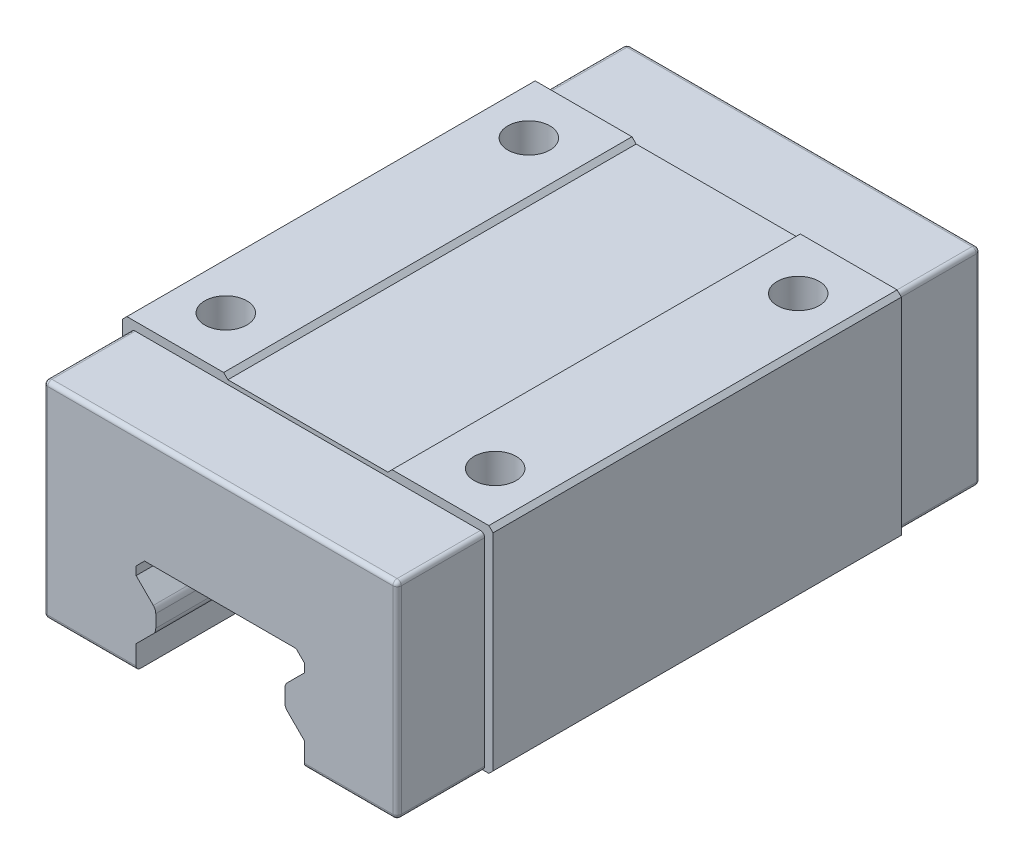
ISO-10303-21;
HEADER;
FILE_DESCRIPTION(('STEP AP214'),'2;1');
FILE_NAME('part.step','',(''),(''),'','','');
FILE_SCHEMA(('AUTOMOTIVE_DESIGN { 1 0 10303 214 1 1 1 1 }'));
ENDSEC;
DATA;
#1=APPLICATION_CONTEXT('core data for automotive mechanical design processes');
#2=APPLICATION_PROTOCOL_DEFINITION('international standard','automotive_design',2000,#1);
#3=PRODUCT_CONTEXT('',#1,'mechanical');
#4=PRODUCT('Part','Part','',(#3));
#5=PRODUCT_RELATED_PRODUCT_CATEGORY('part','',(#4));
#6=PRODUCT_DEFINITION_FORMATION('','',#4);
#7=PRODUCT_DEFINITION_CONTEXT('part definition',#1,'design');
#8=PRODUCT_DEFINITION('design','',#6,#7);
#9=PRODUCT_DEFINITION_SHAPE('','',#8);
#10=(LENGTH_UNIT() NAMED_UNIT(*) SI_UNIT(.MILLI.,.METRE.));
#11=(NAMED_UNIT(*) PLANE_ANGLE_UNIT() SI_UNIT($,.RADIAN.));
#12=(NAMED_UNIT(*) SI_UNIT($,.STERADIAN.) SOLID_ANGLE_UNIT());
#13=UNCERTAINTY_MEASURE_WITH_UNIT(LENGTH_MEASURE(1.E-05),#10,'distance_accuracy_value','');
#14=(GEOMETRIC_REPRESENTATION_CONTEXT(3) GLOBAL_UNCERTAINTY_ASSIGNED_CONTEXT((#13)) GLOBAL_UNIT_ASSIGNED_CONTEXT((#10,
#11,#12)) REPRESENTATION_CONTEXT('',''));
#15=CARTESIAN_POINT('',(0.,0.,0.));
#16=DIRECTION('',(0.,0.,1.));
#17=DIRECTION('',(1.,0.,0.));
#18=AXIS2_PLACEMENT_3D('',#15,#16,#17);
#19=CARTESIAN_POINT('',(-22.,30.,24.25));
#20=DIRECTION('',(0.,-1.,0.));
#21=DIRECTION('',(0.,0.,-1.));
#22=AXIS2_PLACEMENT_3D('',#19,#20,#21);
#23=PLANE('',#22);
#24=CARTESIAN_POINT('',(-16.,30.,18.));
#25=DIRECTION('',(0.,1.,0.));
#26=DIRECTION('',(-1.,0.,0.));
#27=AXIS2_PLACEMENT_3D('',#24,#25,#26);
#28=CIRCLE('',#27,2.5);
#29=CARTESIAN_POINT('',(-18.5,30.,18.));
#30=VERTEX_POINT('',#29);
#31=EDGE_CURVE('E1099',#30,#30,#28,.T.);
#32=ORIENTED_EDGE('',*,*,#31,.F.);
#33=EDGE_LOOP('',(#32));
#34=FACE_BOUND('',#33,.T.);
#35=CARTESIAN_POINT('',(-16.,30.,-18.));
#36=DIRECTION('',(0.,1.,0.));
#37=DIRECTION('',(-1.,0.,0.));
#38=AXIS2_PLACEMENT_3D('',#35,#36,#37);
#39=CIRCLE('',#38,2.5);
#40=CARTESIAN_POINT('',(-18.5,30.,-18.));
#41=VERTEX_POINT('',#40);
#42=EDGE_CURVE('E1077',#41,#41,#39,.T.);
#43=ORIENTED_EDGE('',*,*,#42,.F.);
#44=EDGE_LOOP('',(#43));
#45=FACE_BOUND('',#44,.T.);
#46=DIRECTION('',(-1.,0.,0.));
#47=VECTOR('',#46,1.);
#48=CARTESIAN_POINT('',(-22.,30.,-24.25));
#49=LINE('',#48,#47);
#50=CARTESIAN_POINT('',(-10.,30.,-24.25));
#51=VERTEX_POINT('',#50);
#52=CARTESIAN_POINT('',(-21.5,30.,-24.25));
#53=VERTEX_POINT('',#52);
#54=EDGE_CURVE('E787',#51,#53,#49,.T.);
#55=ORIENTED_EDGE('',*,*,#54,.T.);
#56=DIRECTION('',(0.,0.,1.));
#57=VECTOR('',#56,1.);
#58=CARTESIAN_POINT('',(-21.5,30.,24.25));
#59=LINE('',#58,#57);
#60=CARTESIAN_POINT('',(-21.5,30.,24.25));
#61=VERTEX_POINT('',#60);
#62=EDGE_CURVE('E391',#53,#61,#59,.T.);
#63=ORIENTED_EDGE('',*,*,#62,.T.);
#64=DIRECTION('',(-1.,0.,0.));
#65=VECTOR('',#64,1.);
#66=CARTESIAN_POINT('',(-22.,30.,24.25));
#67=LINE('',#66,#65);
#68=CARTESIAN_POINT('',(-10.,30.,24.25));
#69=VERTEX_POINT('',#68);
#70=EDGE_CURVE('E374',#69,#61,#67,.T.);
#71=ORIENTED_EDGE('',*,*,#70,.F.);
#72=DIRECTION('',(0.,0.,-1.));
#73=VECTOR('',#72,1.);
#74=CARTESIAN_POINT('',(-10.,30.,24.25));
#75=LINE('',#74,#73);
#76=EDGE_CURVE('E388',#69,#51,#75,.T.);
#77=ORIENTED_EDGE('',*,*,#76,.T.);
#78=EDGE_LOOP('',(#55,#63,#71,#77));
#79=FACE_BOUND('',#78,.T.);
#80=ADVANCED_FACE('F39',(#34,#45,#79),#23,.F.);
#81=CARTESIAN_POINT('',(9.99999999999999,16.3,-34.65));
#82=DIRECTION('',(1.,0.,0.));
#83=DIRECTION('',(0.,1.,0.));
#84=AXIS2_PLACEMENT_3D('',#81,#82,#83);
#85=PLANE('',#84);
#86=DIRECTION('',(0.,-1.,0.));
#87=VECTOR('',#86,1.);
#88=CARTESIAN_POINT('',(10.,0.,34.65));
#89=LINE('',#88,#87);
#90=CARTESIAN_POINT('',(9.99999999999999,15.3,34.65));
#91=VERTEX_POINT('',#90);
#92=CARTESIAN_POINT('',(10.,14.3,34.65));
#93=VERTEX_POINT('',#92);
#94=EDGE_CURVE('E810',#91,#93,#89,.T.);
#95=ORIENTED_EDGE('',*,*,#94,.F.);
#96=DIRECTION('',(0.,0.,-1.));
#97=VECTOR('',#96,1.);
#98=CARTESIAN_POINT('',(9.99999999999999,15.3,-34.65));
#99=LINE('',#98,#97);
#100=CARTESIAN_POINT('',(9.99999999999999,15.3,-34.65));
#101=VERTEX_POINT('',#100);
#102=EDGE_CURVE('E820',#91,#101,#99,.T.);
#103=ORIENTED_EDGE('',*,*,#102,.T.);
#104=DIRECTION('',(0.,1.,0.));
#105=VECTOR('',#104,1.);
#106=CARTESIAN_POINT('',(9.99999999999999,16.3,-34.65));
#107=LINE('',#106,#105);
#108=CARTESIAN_POINT('',(10.,14.3,-34.65));
#109=VERTEX_POINT('',#108);
#110=EDGE_CURVE('E945',#109,#101,#107,.T.);
#111=ORIENTED_EDGE('',*,*,#110,.F.);
#112=DIRECTION('',(0.,0.,1.));
#113=VECTOR('',#112,1.);
#114=CARTESIAN_POINT('',(10.,14.3,-42.0286478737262));
#115=LINE('',#114,#113);
#116=EDGE_CURVE('E1057',#109,#93,#115,.T.);
#117=ORIENTED_EDGE('',*,*,#116,.T.);
#118=EDGE_LOOP('',(#95,#103,#111,#117));
#119=FACE_BOUND('',#118,.T.);
#120=ADVANCED_FACE('F1117',(#119),#85,.F.);
#121=CARTESIAN_POINT('',(-10.,16.3,-34.65));
#122=DIRECTION('',(-1.,0.,0.));
#123=DIRECTION('',(0.,-1.,0.));
#124=AXIS2_PLACEMENT_3D('',#121,#122,#123);
#125=PLANE('',#124);
#126=DIRECTION('',(0.,-1.,0.));
#127=VECTOR('',#126,1.);
#128=CARTESIAN_POINT('',(-10.,16.3,34.65));
#129=LINE('',#128,#127);
#130=CARTESIAN_POINT('',(-10.,7.3,34.65));
#131=VERTEX_POINT('',#130);
#132=CARTESIAN_POINT('',(-10.,4.99999999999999,34.65));
#133=VERTEX_POINT('',#132);
#134=EDGE_CURVE('E954',#131,#133,#129,.T.);
#135=ORIENTED_EDGE('',*,*,#134,.T.);
#136=CARTESIAN_POINT('',(-10.,4.99999999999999,34.15));
#137=DIRECTION('',(-1.,0.,0.));
#138=DIRECTION('',(0.,-1.,0.));
#139=AXIS2_PLACEMENT_3D('',#136,#137,#138);
#140=CIRCLE('',#139,0.5);
#141=CARTESIAN_POINT('',(-10.,4.5,34.15));
#142=VERTEX_POINT('',#141);
#143=EDGE_CURVE('E560',#133,#142,#140,.F.);
#144=ORIENTED_EDGE('',*,*,#143,.T.);
#145=DIRECTION('',(0.,0.,1.));
#146=VECTOR('',#145,1.);
#147=CARTESIAN_POINT('',(-10.,4.5,24.25));
#148=LINE('',#147,#146);
#149=CARTESIAN_POINT('',(-10.,4.5,-34.15));
#150=VERTEX_POINT('',#149);
#151=EDGE_CURVE('E750',#150,#142,#148,.T.);
#152=ORIENTED_EDGE('',*,*,#151,.F.);
#153=CARTESIAN_POINT('',(-10.,5.,-34.15));
#154=DIRECTION('',(-1.,0.,0.));
#155=DIRECTION('',(0.,-1.,0.));
#156=AXIS2_PLACEMENT_3D('',#153,#154,#155);
#157=CIRCLE('',#156,0.5);
#158=CARTESIAN_POINT('',(-10.,5.,-34.65));
#159=VERTEX_POINT('',#158);
#160=EDGE_CURVE('E557',#150,#159,#157,.F.);
#161=ORIENTED_EDGE('',*,*,#160,.T.);
#162=DIRECTION('',(0.,-1.,0.));
#163=VECTOR('',#162,1.);
#164=CARTESIAN_POINT('',(-10.,16.3,-34.65));
#165=LINE('',#164,#163);
#166=CARTESIAN_POINT('',(-10.,7.3,-34.65));
#167=VERTEX_POINT('',#166);
#168=EDGE_CURVE('E949',#167,#159,#165,.T.);
#169=ORIENTED_EDGE('',*,*,#168,.F.);
#170=DIRECTION('',(0.,0.,1.));
#171=VECTOR('',#170,1.);
#172=CARTESIAN_POINT('',(-10.,7.3,-42.0286478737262));
#173=LINE('',#172,#171);
#174=EDGE_CURVE('E918',#167,#131,#173,.T.);
#175=ORIENTED_EDGE('',*,*,#174,.T.);
#176=EDGE_LOOP('',(#135,#144,#152,#161,#169,#175));
#177=FACE_BOUND('',#176,.T.);
#178=ADVANCED_FACE('F968',(#177),#125,.F.);
#179=CARTESIAN_POINT('',(-22.,4.5,24.25));
#180=DIRECTION('',(0.,1.,0.));
#181=DIRECTION('',(-1.,0.,0.));
#182=AXIS2_PLACEMENT_3D('',#179,#180,#181);
#183=PLANE('',#182);
#184=DIRECTION('',(0.,0.,-1.));
#185=VECTOR('',#184,1.);
#186=CARTESIAN_POINT('',(20.5,4.5,24.25));
#187=LINE('',#186,#185);
#188=CARTESIAN_POINT('',(20.5,4.5,24.25));
#189=VERTEX_POINT('',#188);
#190=CARTESIAN_POINT('',(20.5,4.5,34.15));
#191=VERTEX_POINT('',#190);
#192=EDGE_CURVE('E507',#189,#191,#187,.F.);
#193=ORIENTED_EDGE('',*,*,#192,.T.);
#194=DIRECTION('',(1.,0.,0.));
#195=VECTOR('',#194,1.);
#196=CARTESIAN_POINT('',(-22.,4.5,34.15));
#197=LINE('',#196,#195);
#198=CARTESIAN_POINT('',(10.,4.5,34.15));
#199=VERTEX_POINT('',#198);
#200=EDGE_CURVE('E509',#191,#199,#197,.F.);
#201=ORIENTED_EDGE('',*,*,#200,.T.);
#202=DIRECTION('',(0.,0.,-1.));
#203=VECTOR('',#202,1.);
#204=CARTESIAN_POINT('',(10.,4.5,24.25));
#205=LINE('',#204,#203);
#206=CARTESIAN_POINT('',(10.,4.5,-34.15));
#207=VERTEX_POINT('',#206);
#208=EDGE_CURVE('E742',#199,#207,#205,.T.);
#209=ORIENTED_EDGE('',*,*,#208,.T.);
#210=DIRECTION('',(1.,0.,0.));
#211=VECTOR('',#210,1.);
#212=CARTESIAN_POINT('',(21.,4.5,-34.15));
#213=LINE('',#212,#211);
#214=CARTESIAN_POINT('',(20.5,4.5,-34.15));
#215=VERTEX_POINT('',#214);
#216=EDGE_CURVE('E504',#207,#215,#213,.T.);
#217=ORIENTED_EDGE('',*,*,#216,.T.);
#218=DIRECTION('',(0.,0.,-1.));
#219=VECTOR('',#218,1.);
#220=CARTESIAN_POINT('',(20.5,4.5,24.25));
#221=LINE('',#220,#219);
#222=CARTESIAN_POINT('',(20.5,4.5,-24.25));
#223=VERTEX_POINT('',#222);
#224=EDGE_CURVE('E500',#215,#223,#221,.F.);
#225=ORIENTED_EDGE('',*,*,#224,.T.);
#226=DIRECTION('',(1.,0.,0.));
#227=VECTOR('',#226,1.);
#228=CARTESIAN_POINT('',(-22.,4.5,-24.25));
#229=LINE('',#228,#227);
#230=CARTESIAN_POINT('',(21.5,4.5,-24.25));
#231=VERTEX_POINT('',#230);
#232=EDGE_CURVE('E796',#223,#231,#229,.T.);
#233=ORIENTED_EDGE('',*,*,#232,.T.);
#234=DIRECTION('',(0.,0.,1.));
#235=VECTOR('',#234,1.);
#236=CARTESIAN_POINT('',(21.5,4.5,24.25));
#237=LINE('',#236,#235);
#238=CARTESIAN_POINT('',(21.5,4.5,24.25));
#239=VERTEX_POINT('',#238);
#240=EDGE_CURVE('E448',#231,#239,#237,.T.);
#241=ORIENTED_EDGE('',*,*,#240,.T.);
#242=DIRECTION('',(1.,0.,0.));
#243=VECTOR('',#242,1.);
#244=CARTESIAN_POINT('',(-22.,4.5,24.25));
#245=LINE('',#244,#243);
#246=EDGE_CURVE('E779',#189,#239,#245,.T.);
#247=ORIENTED_EDGE('',*,*,#246,.F.);
#248=EDGE_LOOP('',(#193,#201,#209,#217,#225,#233,#241,#247));
#249=FACE_BOUND('',#248,.T.);
#250=ADVANCED_FACE('F741',(#249),#183,.F.);
#251=CARTESIAN_POINT('',(0.,0.,24.25));
#252=DIRECTION('',(0.,0.,-1.));
#253=DIRECTION('',(-1.,0.,0.));
#254=AXIS2_PLACEMENT_3D('',#251,#252,#253);
#255=PLANE('',#254);
#256=DIRECTION('',(0.,1.,0.));
#257=VECTOR('',#256,1.);
#258=CARTESIAN_POINT('',(22.,4.5,24.25));
#259=LINE('',#258,#257);
#260=CARTESIAN_POINT('',(22.,5.,24.25));
#261=VERTEX_POINT('',#260);
#262=CARTESIAN_POINT('',(22.,29.5,24.25));
#263=VERTEX_POINT('',#262);
#264=EDGE_CURVE('E394',#261,#263,#259,.T.);
#265=ORIENTED_EDGE('',*,*,#264,.T.);
#266=DIRECTION('',(0.707106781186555,-0.70710678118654,0.));
#267=VECTOR('',#266,1.);
#268=CARTESIAN_POINT('',(21.5,30.,24.25));
#269=LINE('',#268,#267);
#270=CARTESIAN_POINT('',(21.5,30.,24.25));
#271=VERTEX_POINT('',#270);
#272=EDGE_CURVE('E445',#263,#271,#269,.F.);
#273=ORIENTED_EDGE('',*,*,#272,.T.);
#274=CARTESIAN_POINT('',(10.,30.,24.25));
#275=VERTEX_POINT('',#274);
#276=EDGE_CURVE('E393',#271,#275,#67,.T.);
#277=ORIENTED_EDGE('',*,*,#276,.T.);
#278=DIRECTION('',(0.70710678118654,0.707106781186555,0.));
#279=VECTOR('',#278,1.);
#280=CARTESIAN_POINT('',(-9.9999999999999,9.99999999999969,24.25));
#281=LINE('',#280,#279);
#282=CARTESIAN_POINT('',(9.5,29.5,24.25));
#283=VERTEX_POINT('',#282);
#284=EDGE_CURVE('E470',#275,#283,#281,.F.);
#285=ORIENTED_EDGE('',*,*,#284,.T.);
#286=DIRECTION('',(1.,0.,0.));
#287=VECTOR('',#286,1.);
#288=CARTESIAN_POINT('',(-10.,29.5,24.25));
#289=LINE('',#288,#287);
#290=CARTESIAN_POINT('',(-9.50000000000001,29.5,24.25));
#291=VERTEX_POINT('',#290);
#292=EDGE_CURVE('E377',#291,#283,#289,.T.);
#293=ORIENTED_EDGE('',*,*,#292,.F.);
#294=DIRECTION('',(0.707106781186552,-0.707106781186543,0.));
#295=VECTOR('',#294,1.);
#296=CARTESIAN_POINT('',(10.0000000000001,10.0000000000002,24.25));
#297=LINE('',#296,#295);
#298=EDGE_CURVE('E370',#291,#69,#297,.F.);
#299=ORIENTED_EDGE('',*,*,#298,.T.);
#300=ORIENTED_EDGE('',*,*,#70,.T.);
#301=DIRECTION('',(0.707106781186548,0.707106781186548,0.));
#302=VECTOR('',#301,1.);
#303=CARTESIAN_POINT('',(-22.,29.5,24.25));
#304=LINE('',#303,#302);
#305=CARTESIAN_POINT('',(-22.,29.5,24.25));
#306=VERTEX_POINT('',#305);
#307=EDGE_CURVE('E436',#61,#306,#304,.F.);
#308=ORIENTED_EDGE('',*,*,#307,.T.);
#309=DIRECTION('',(0.,-1.,0.));
#310=VECTOR('',#309,1.);
#311=CARTESIAN_POINT('',(-22.,4.5,24.25));
#312=LINE('',#311,#310);
#313=CARTESIAN_POINT('',(-22.,5.,24.25));
#314=VERTEX_POINT('',#313);
#315=EDGE_CURVE('E775',#306,#314,#312,.T.);
#316=ORIENTED_EDGE('',*,*,#315,.T.);
#317=DIRECTION('',(-0.707106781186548,0.707106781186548,0.));
#318=VECTOR('',#317,1.);
#319=CARTESIAN_POINT('',(-21.5,4.5,24.25));
#320=LINE('',#319,#318);
#321=CARTESIAN_POINT('',(-21.5,4.5,24.25));
#322=VERTEX_POINT('',#321);
#323=EDGE_CURVE('E439',#314,#322,#320,.F.);
#324=ORIENTED_EDGE('',*,*,#323,.T.);
#325=CARTESIAN_POINT('',(-20.5,4.5,24.25));
#326=VERTEX_POINT('',#325);
#327=EDGE_CURVE('E780',#322,#326,#245,.T.);
#328=ORIENTED_EDGE('',*,*,#327,.T.);
#329=CARTESIAN_POINT('',(-20.5,4.99999999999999,24.25));
#330=DIRECTION('',(0.,0.,-1.));
#331=DIRECTION('',(-1.,0.,0.));
#332=AXIS2_PLACEMENT_3D('',#329,#330,#331);
#333=CIRCLE('',#332,0.5);
#334=CARTESIAN_POINT('',(-21.,4.99999999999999,24.25));
#335=VERTEX_POINT('',#334);
#336=EDGE_CURVE('E601',#326,#335,#333,.T.);
#337=ORIENTED_EDGE('',*,*,#336,.T.);
#338=DIRECTION('',(0.,-1.,0.));
#339=VECTOR('',#338,1.);
#340=CARTESIAN_POINT('',(-21.,0.,24.25));
#341=LINE('',#340,#339);
#342=CARTESIAN_POINT('',(-21.,28.5,24.25));
#343=VERTEX_POINT('',#342);
#344=EDGE_CURVE('E765',#343,#335,#341,.T.);
#345=ORIENTED_EDGE('',*,*,#344,.F.);
#346=CARTESIAN_POINT('',(-20.5,28.5,24.25));
#347=DIRECTION('',(0.,0.,-1.));
#348=DIRECTION('',(-1.,0.,0.));
#349=AXIS2_PLACEMENT_3D('',#346,#347,#348);
#350=CIRCLE('',#349,0.5);
#351=CARTESIAN_POINT('',(-20.5,29.,24.25));
#352=VERTEX_POINT('',#351);
#353=EDGE_CURVE('E608',#343,#352,#350,.T.);
#354=ORIENTED_EDGE('',*,*,#353,.T.);
#355=DIRECTION('',(-1.,0.,0.));
#356=VECTOR('',#355,1.);
#357=CARTESIAN_POINT('',(0.,29.,24.25));
#358=LINE('',#357,#356);
#359=CARTESIAN_POINT('',(20.5,29.,24.25));
#360=VERTEX_POINT('',#359);
#361=EDGE_CURVE('E749',#360,#352,#358,.T.);
#362=ORIENTED_EDGE('',*,*,#361,.F.);
#363=CARTESIAN_POINT('',(20.5,28.5,24.25));
#364=DIRECTION('',(0.,0.,-1.));
#365=DIRECTION('',(-1.,0.,0.));
#366=AXIS2_PLACEMENT_3D('',#363,#364,#365);
#367=CIRCLE('',#366,0.5);
#368=CARTESIAN_POINT('',(21.,28.5,24.25));
#369=VERTEX_POINT('',#368);
#370=EDGE_CURVE('E611',#360,#369,#367,.T.);
#371=ORIENTED_EDGE('',*,*,#370,.T.);
#372=DIRECTION('',(0.,1.,0.));
#373=VECTOR('',#372,1.);
#374=CARTESIAN_POINT('',(21.,0.,24.25));
#375=LINE('',#374,#373);
#376=CARTESIAN_POINT('',(21.,5.,24.25));
#377=VERTEX_POINT('',#376);
#378=EDGE_CURVE('E754',#377,#369,#375,.T.);
#379=ORIENTED_EDGE('',*,*,#378,.F.);
#380=CARTESIAN_POINT('',(20.5,5.,24.25));
#381=DIRECTION('',(0.,0.,-1.));
#382=DIRECTION('',(-1.,0.,0.));
#383=AXIS2_PLACEMENT_3D('',#380,#381,#382);
#384=CIRCLE('',#383,0.5);
#385=EDGE_CURVE('E604',#377,#189,#384,.T.);
#386=ORIENTED_EDGE('',*,*,#385,.T.);
#387=ORIENTED_EDGE('',*,*,#246,.T.);
#388=DIRECTION('',(-0.707106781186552,-0.707106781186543,0.));
#389=VECTOR('',#388,1.);
#390=CARTESIAN_POINT('',(22.,5.,24.25));
#391=LINE('',#390,#389);
#392=EDGE_CURVE('E442',#239,#261,#391,.F.);
#393=ORIENTED_EDGE('',*,*,#392,.T.);
#394=EDGE_LOOP('',(#265,#273,#277,#285,#293,#299,#300,#308,#316,#324,#328,#337,#345,#354,#362,
#371,#379,#386,#387,#393));
#395=FACE_BOUND('',#394,.T.);
#396=ADVANCED_FACE('F373',(#395),#255,.F.);
#397=CARTESIAN_POINT('',(0.,0.,-24.25));
#398=DIRECTION('',(0.,0.,-1.));
#399=DIRECTION('',(-1.,0.,0.));
#400=AXIS2_PLACEMENT_3D('',#397,#398,#399);
#401=PLANE('',#400);
#402=CARTESIAN_POINT('',(21.5,30.,-24.25));
#403=VERTEX_POINT('',#402);
#404=CARTESIAN_POINT('',(10.,30.,-24.25));
#405=VERTEX_POINT('',#404);
#406=EDGE_CURVE('E788',#403,#405,#49,.T.);
#407=ORIENTED_EDGE('',*,*,#406,.F.);
#408=DIRECTION('',(-0.707106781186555,0.70710678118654,0.));
#409=VECTOR('',#408,1.);
#410=CARTESIAN_POINT('',(25.7499999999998,25.7500000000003,-24.25));
#411=LINE('',#410,#409);
#412=CARTESIAN_POINT('',(22.,29.5,-24.25));
#413=VERTEX_POINT('',#412);
#414=EDGE_CURVE('E426',#403,#413,#411,.F.);
#415=ORIENTED_EDGE('',*,*,#414,.T.);
#416=DIRECTION('',(0.,1.,0.));
#417=VECTOR('',#416,1.);
#418=CARTESIAN_POINT('',(22.,4.5,-24.25));
#419=LINE('',#418,#417);
#420=CARTESIAN_POINT('',(22.,5.,-24.25));
#421=VERTEX_POINT('',#420);
#422=EDGE_CURVE('E769',#421,#413,#419,.T.);
#423=ORIENTED_EDGE('',*,*,#422,.F.);
#424=DIRECTION('',(0.707106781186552,0.707106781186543,0.));
#425=VECTOR('',#424,1.);
#426=CARTESIAN_POINT('',(8.49999999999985,-8.49999999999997,-24.25));
#427=LINE('',#426,#425);
#428=EDGE_CURVE('E423',#421,#231,#427,.F.);
#429=ORIENTED_EDGE('',*,*,#428,.T.);
#430=ORIENTED_EDGE('',*,*,#232,.F.);
#431=CARTESIAN_POINT('',(20.5,5.,-24.25));
#432=DIRECTION('',(0.,0.,-1.));
#433=DIRECTION('',(-1.,0.,0.));
#434=AXIS2_PLACEMENT_3D('',#431,#432,#433);
#435=CIRCLE('',#434,0.5);
#436=CARTESIAN_POINT('',(21.,5.,-24.25));
#437=VERTEX_POINT('',#436);
#438=EDGE_CURVE('E614',#223,#437,#435,.F.);
#439=ORIENTED_EDGE('',*,*,#438,.T.);
#440=DIRECTION('',(0.,1.,0.));
#441=VECTOR('',#440,1.);
#442=CARTESIAN_POINT('',(21.,0.,-24.25));
#443=LINE('',#442,#441);
#444=CARTESIAN_POINT('',(21.,28.5,-24.25));
#445=VERTEX_POINT('',#444);
#446=EDGE_CURVE('E802',#437,#445,#443,.T.);
#447=ORIENTED_EDGE('',*,*,#446,.T.);
#448=CARTESIAN_POINT('',(20.5,28.5,-24.25));
#449=DIRECTION('',(0.,0.,-1.));
#450=DIRECTION('',(-1.,0.,0.));
#451=AXIS2_PLACEMENT_3D('',#448,#449,#450);
#452=CIRCLE('',#451,0.5);
#453=CARTESIAN_POINT('',(20.5,29.,-24.25));
#454=VERTEX_POINT('',#453);
#455=EDGE_CURVE('E49',#445,#454,#452,.F.);
#456=ORIENTED_EDGE('',*,*,#455,.T.);
#457=DIRECTION('',(-1.,0.,0.));
#458=VECTOR('',#457,1.);
#459=CARTESIAN_POINT('',(0.,29.,-24.25));
#460=LINE('',#459,#458);
#461=CARTESIAN_POINT('',(-20.5,29.,-24.25));
#462=VERTEX_POINT('',#461);
#463=EDGE_CURVE('E783',#454,#462,#460,.T.);
#464=ORIENTED_EDGE('',*,*,#463,.T.);
#465=CARTESIAN_POINT('',(-20.5,28.5,-24.25));
#466=DIRECTION('',(0.,0.,-1.));
#467=DIRECTION('',(-1.,0.,0.));
#468=AXIS2_PLACEMENT_3D('',#465,#466,#467);
#469=CIRCLE('',#468,0.5);
#470=CARTESIAN_POINT('',(-21.,28.5,-24.25));
#471=VERTEX_POINT('',#470);
#472=EDGE_CURVE('E11',#462,#471,#469,.F.);
#473=ORIENTED_EDGE('',*,*,#472,.T.);
#474=DIRECTION('',(0.,-1.,0.));
#475=VECTOR('',#474,1.);
#476=CARTESIAN_POINT('',(-21.,0.,-24.25));
#477=LINE('',#476,#475);
#478=CARTESIAN_POINT('',(-21.,4.99999999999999,-24.25));
#479=VERTEX_POINT('',#478);
#480=EDGE_CURVE('E806',#471,#479,#477,.T.);
#481=ORIENTED_EDGE('',*,*,#480,.T.);
#482=CARTESIAN_POINT('',(-20.5,4.99999999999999,-24.25));
#483=DIRECTION('',(0.,0.,-1.));
#484=DIRECTION('',(-1.,0.,0.));
#485=AXIS2_PLACEMENT_3D('',#482,#483,#484);
#486=CIRCLE('',#485,0.5);
#487=CARTESIAN_POINT('',(-20.5,4.5,-24.25));
#488=VERTEX_POINT('',#487);
#489=EDGE_CURVE('E597',#479,#488,#486,.F.);
#490=ORIENTED_EDGE('',*,*,#489,.T.);
#491=CARTESIAN_POINT('',(-21.5,4.5,-24.25));
#492=VERTEX_POINT('',#491);
#493=EDGE_CURVE('E771',#492,#488,#229,.T.);
#494=ORIENTED_EDGE('',*,*,#493,.F.);
#495=DIRECTION('',(0.707106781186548,-0.707106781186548,0.));
#496=VECTOR('',#495,1.);
#497=CARTESIAN_POINT('',(-8.49999999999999,-8.49999999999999,-24.25));
#498=LINE('',#497,#496);
#499=CARTESIAN_POINT('',(-22.,5.,-24.25));
#500=VERTEX_POINT('',#499);
#501=EDGE_CURVE('E420',#492,#500,#498,.F.);
#502=ORIENTED_EDGE('',*,*,#501,.T.);
#503=DIRECTION('',(0.,-1.,0.));
#504=VECTOR('',#503,1.);
#505=CARTESIAN_POINT('',(-22.,4.5,-24.25));
#506=LINE('',#505,#504);
#507=CARTESIAN_POINT('',(-22.,29.5,-24.25));
#508=VERTEX_POINT('',#507);
#509=EDGE_CURVE('E792',#508,#500,#506,.T.);
#510=ORIENTED_EDGE('',*,*,#509,.F.);
#511=DIRECTION('',(-0.707106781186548,-0.707106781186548,0.));
#512=VECTOR('',#511,1.);
#513=CARTESIAN_POINT('',(-25.75,25.75,-24.25));
#514=LINE('',#513,#512);
#515=EDGE_CURVE('E417',#508,#53,#514,.F.);
#516=ORIENTED_EDGE('',*,*,#515,.T.);
#517=ORIENTED_EDGE('',*,*,#54,.F.);
#518=DIRECTION('',(-0.707106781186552,0.707106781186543,0.));
#519=VECTOR('',#518,1.);
#520=CARTESIAN_POINT('',(-9.50000000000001,29.5,-24.25));
#521=LINE('',#520,#519);
#522=CARTESIAN_POINT('',(-9.50000000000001,29.5,-24.25));
#523=VERTEX_POINT('',#522);
#524=EDGE_CURVE('E383',#51,#523,#521,.F.);
#525=ORIENTED_EDGE('',*,*,#524,.T.);
#526=DIRECTION('',(-1.,0.,0.));
#527=VECTOR('',#526,1.);
#528=CARTESIAN_POINT('',(0.,29.5,-24.25));
#529=LINE('',#528,#527);
#530=CARTESIAN_POINT('',(9.5,29.5,-24.25));
#531=VERTEX_POINT('',#530);
#532=EDGE_CURVE('E399',#531,#523,#529,.T.);
#533=ORIENTED_EDGE('',*,*,#532,.F.);
#534=DIRECTION('',(-0.70710678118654,-0.707106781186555,0.));
#535=VECTOR('',#534,1.);
#536=CARTESIAN_POINT('',(10.,30.,-24.25));
#537=LINE('',#536,#535);
#538=EDGE_CURVE('E384',#531,#405,#537,.F.);
#539=ORIENTED_EDGE('',*,*,#538,.T.);
#540=EDGE_LOOP('',(#407,#415,#423,#429,#430,#439,#447,#456,#464,#473,#481,#490,#494,#502,#510,
#516,#517,#525,#533,#539));
#541=FACE_BOUND('',#540,.T.);
#542=ADVANCED_FACE('F1024',(#541),#401,.T.);
#543=CARTESIAN_POINT('',(22.,4.5,24.25));
#544=DIRECTION('',(-1.,0.,0.));
#545=DIRECTION('',(0.,-1.,0.));
#546=AXIS2_PLACEMENT_3D('',#543,#544,#545);
#547=PLANE('',#546);
#548=ORIENTED_EDGE('',*,*,#422,.T.);
#549=DIRECTION('',(0.,0.,1.));
#550=VECTOR('',#549,1.);
#551=CARTESIAN_POINT('',(22.,29.5,24.25));
#552=LINE('',#551,#550);
#553=EDGE_CURVE('E433',#413,#263,#552,.T.);
#554=ORIENTED_EDGE('',*,*,#553,.T.);
#555=ORIENTED_EDGE('',*,*,#264,.F.);
#556=DIRECTION('',(0.,0.,-1.));
#557=VECTOR('',#556,1.);
#558=CARTESIAN_POINT('',(22.,5.,24.25));
#559=LINE('',#558,#557);
#560=EDGE_CURVE('E429',#261,#421,#559,.T.);
#561=ORIENTED_EDGE('',*,*,#560,.T.);
#562=EDGE_LOOP('',(#548,#554,#555,#561));
#563=FACE_BOUND('',#562,.T.);
#564=ADVANCED_FACE('F1193',(#563),#547,.F.);
#565=CARTESIAN_POINT('',(16.,30.,-18.));
#566=DIRECTION('',(0.,1.,0.));
#567=DIRECTION('',(-1.,0.,0.));
#568=AXIS2_PLACEMENT_3D('',#565,#566,#567);
#569=CIRCLE('',#568,2.5);
#570=CARTESIAN_POINT('',(13.5,30.,-18.));
#571=VERTEX_POINT('',#570);
#572=EDGE_CURVE('E1084',#571,#571,#569,.T.);
#573=ORIENTED_EDGE('',*,*,#572,.F.);
#574=EDGE_LOOP('',(#573));
#575=FACE_BOUND('',#574,.T.);
#576=CARTESIAN_POINT('',(16.,30.,18.));
#577=DIRECTION('',(0.,1.,0.));
#578=DIRECTION('',(-1.,0.,0.));
#579=AXIS2_PLACEMENT_3D('',#576,#577,#578);
#580=CIRCLE('',#579,2.5);
#581=CARTESIAN_POINT('',(13.5,30.,18.));
#582=VERTEX_POINT('',#581);
#583=EDGE_CURVE('E1092',#582,#582,#580,.T.);
#584=ORIENTED_EDGE('',*,*,#583,.F.);
#585=EDGE_LOOP('',(#584));
#586=FACE_BOUND('',#585,.T.);
#587=ORIENTED_EDGE('',*,*,#276,.F.);
#588=DIRECTION('',(0.,0.,-1.));
#589=VECTOR('',#588,1.);
#590=CARTESIAN_POINT('',(21.5,30.,24.25));
#591=LINE('',#590,#589);
#592=EDGE_CURVE('E406',#271,#403,#591,.T.);
#593=ORIENTED_EDGE('',*,*,#592,.T.);
#594=ORIENTED_EDGE('',*,*,#406,.T.);
#595=DIRECTION('',(0.,0.,1.));
#596=VECTOR('',#595,1.);
#597=CARTESIAN_POINT('',(9.99999999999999,30.,24.25));
#598=LINE('',#597,#596);
#599=EDGE_CURVE('E400',#405,#275,#598,.T.);
#600=ORIENTED_EDGE('',*,*,#599,.T.);
#601=EDGE_LOOP('',(#587,#593,#594,#600));
#602=FACE_BOUND('',#601,.T.);
#603=ADVANCED_FACE('F1119',(#575,#586,#602),#23,.F.);
#604=CARTESIAN_POINT('',(-22.,4.5,24.25));
#605=DIRECTION('',(1.,0.,0.));
#606=DIRECTION('',(0.,0.,-1.));
#607=AXIS2_PLACEMENT_3D('',#604,#605,#606);
#608=PLANE('',#607);
#609=ORIENTED_EDGE('',*,*,#509,.T.);
#610=DIRECTION('',(0.,0.,1.));
#611=VECTOR('',#610,1.);
#612=CARTESIAN_POINT('',(-22.,5.,24.25));
#613=LINE('',#612,#611);
#614=EDGE_CURVE('E459',#500,#314,#613,.T.);
#615=ORIENTED_EDGE('',*,*,#614,.T.);
#616=ORIENTED_EDGE('',*,*,#315,.F.);
#617=DIRECTION('',(0.,0.,-1.));
#618=VECTOR('',#617,1.);
#619=CARTESIAN_POINT('',(-22.,29.5,24.25));
#620=LINE('',#619,#618);
#621=EDGE_CURVE('E455',#306,#508,#620,.T.);
#622=ORIENTED_EDGE('',*,*,#621,.T.);
#623=EDGE_LOOP('',(#609,#615,#616,#622));
#624=FACE_BOUND('',#623,.T.);
#625=ADVANCED_FACE('F1196',(#624),#608,.F.);
#626=DIRECTION('',(0.,0.,-1.));
#627=VECTOR('',#626,1.);
#628=CARTESIAN_POINT('',(-20.5,4.5,24.25));
#629=LINE('',#628,#627);
#630=CARTESIAN_POINT('',(-20.5,4.5,34.15));
#631=VERTEX_POINT('',#630);
#632=EDGE_CURVE('E487',#631,#326,#629,.T.);
#633=ORIENTED_EDGE('',*,*,#632,.T.);
#634=ORIENTED_EDGE('',*,*,#327,.F.);
#635=DIRECTION('',(0.,0.,-1.));
#636=VECTOR('',#635,1.);
#637=CARTESIAN_POINT('',(-21.5,4.5,24.25));
#638=LINE('',#637,#636);
#639=EDGE_CURVE('E451',#322,#492,#638,.T.);
#640=ORIENTED_EDGE('',*,*,#639,.T.);
#641=ORIENTED_EDGE('',*,*,#493,.T.);
#642=DIRECTION('',(0.,0.,-1.));
#643=VECTOR('',#642,1.);
#644=CARTESIAN_POINT('',(-20.5,4.5,24.25));
#645=LINE('',#644,#643);
#646=CARTESIAN_POINT('',(-20.5,4.5,-34.15));
#647=VERTEX_POINT('',#646);
#648=EDGE_CURVE('E480',#488,#647,#645,.T.);
#649=ORIENTED_EDGE('',*,*,#648,.T.);
#650=DIRECTION('',(1.,0.,0.));
#651=VECTOR('',#650,1.);
#652=CARTESIAN_POINT('',(-10.,4.5,-34.15));
#653=LINE('',#652,#651);
#654=EDGE_CURVE('E477',#647,#150,#653,.T.);
#655=ORIENTED_EDGE('',*,*,#654,.T.);
#656=ORIENTED_EDGE('',*,*,#151,.T.);
#657=DIRECTION('',(1.,0.,0.));
#658=VECTOR('',#657,1.);
#659=CARTESIAN_POINT('',(-22.,4.5,34.15));
#660=LINE('',#659,#658);
#661=EDGE_CURVE('E484',#142,#631,#660,.F.);
#662=ORIENTED_EDGE('',*,*,#661,.T.);
#663=EDGE_LOOP('',(#633,#634,#640,#641,#649,#655,#656,#662));
#664=FACE_BOUND('',#663,.T.);
#665=ADVANCED_FACE('F980',(#664),#183,.F.);
#666=CARTESIAN_POINT('',(0.,0.,-34.65));
#667=DIRECTION('',(0.,0.,-1.));
#668=DIRECTION('',(-1.,0.,0.));
#669=AXIS2_PLACEMENT_3D('',#666,#667,#668);
#670=PLANE('',#669);
#671=DIRECTION('',(0.,1.,0.));
#672=VECTOR('',#671,1.);
#673=CARTESIAN_POINT('',(20.5,4.5,-34.65));
#674=LINE('',#673,#672);
#675=CARTESIAN_POINT('',(20.5,28.5,-34.65));
#676=VERTEX_POINT('',#675);
#677=CARTESIAN_POINT('',(20.5,5.,-34.65));
#678=VERTEX_POINT('',#677);
#679=EDGE_CURVE('E521',#676,#678,#674,.F.);
#680=ORIENTED_EDGE('',*,*,#679,.T.);
#681=DIRECTION('',(1.,0.,0.));
#682=VECTOR('',#681,1.);
#683=CARTESIAN_POINT('',(9.99999999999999,5.,-34.65));
#684=LINE('',#683,#682);
#685=CARTESIAN_POINT('',(10.,5.,-34.65));
#686=VERTEX_POINT('',#685);
#687=EDGE_CURVE('E524',#678,#686,#684,.F.);
#688=ORIENTED_EDGE('',*,*,#687,.T.);
#689=CARTESIAN_POINT('',(10.,7.30000000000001,-34.65));
#690=VERTEX_POINT('',#689);
#691=EDGE_CURVE('E941',#686,#690,#107,.T.);
#692=ORIENTED_EDGE('',*,*,#691,.T.);
#693=DIRECTION('',(0.707106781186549,-0.707106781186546,0.));
#694=VECTOR('',#693,1.);
#695=CARTESIAN_POINT('',(10.,7.3,-34.65));
#696=LINE('',#695,#694);
#697=CARTESIAN_POINT('',(7.95955988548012,9.34044011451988,-34.65));
#698=VERTEX_POINT('',#697);
#699=EDGE_CURVE('E1043',#698,#690,#696,.T.);
#700=ORIENTED_EDGE('',*,*,#699,.F.);
#701=CARTESIAN_POINT('',(8.66666666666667,10.0475468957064,-34.65));
#702=DIRECTION('',(0.,0.,-1.));
#703=DIRECTION('',(-1.,0.,0.));
#704=AXIS2_PLACEMENT_3D('',#701,#702,#703);
#705=CIRCLE('',#704,1.);
#706=CARTESIAN_POINT('',(7.66666666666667,10.0475468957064,-34.65));
#707=VERTEX_POINT('',#706);
#708=EDGE_CURVE('E870',#698,#707,#705,.T.);
#709=ORIENTED_EDGE('',*,*,#708,.T.);
#710=DIRECTION('',(0.,-1.,0.));
#711=VECTOR('',#710,1.);
#712=CARTESIAN_POINT('',(7.66666666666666,9.63333333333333,-34.65));
#713=LINE('',#712,#711);
#714=CARTESIAN_POINT('',(7.66666666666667,11.5524531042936,-34.65));
#715=VERTEX_POINT('',#714);
#716=EDGE_CURVE('E1045',#715,#707,#713,.T.);
#717=ORIENTED_EDGE('',*,*,#716,.F.);
#718=CARTESIAN_POINT('',(8.66666666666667,11.5524531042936,-34.65));
#719=DIRECTION('',(0.,0.,-1.));
#720=DIRECTION('',(-1.,0.,0.));
#721=AXIS2_PLACEMENT_3D('',#718,#719,#720);
#722=CIRCLE('',#721,1.);
#723=CARTESIAN_POINT('',(7.95955988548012,12.2595598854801,-34.65));
#724=VERTEX_POINT('',#723);
#725=EDGE_CURVE('E867',#715,#724,#722,.T.);
#726=ORIENTED_EDGE('',*,*,#725,.T.);
#727=DIRECTION('',(-0.707106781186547,-0.707106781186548,0.));
#728=VECTOR('',#727,1.);
#729=CARTESIAN_POINT('',(7.66666666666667,11.9666666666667,-34.65));
#730=LINE('',#729,#728);
#731=EDGE_CURVE('E1049',#109,#724,#730,.T.);
#732=ORIENTED_EDGE('',*,*,#731,.F.);
#733=ORIENTED_EDGE('',*,*,#110,.T.);
#734=DIRECTION('',(0.707106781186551,-0.707106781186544,0.));
#735=VECTOR('',#734,1.);
#736=CARTESIAN_POINT('',(8.99999999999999,16.3,-34.65));
#737=LINE('',#736,#735);
#738=CARTESIAN_POINT('',(8.99999999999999,16.3,-34.65));
#739=VERTEX_POINT('',#738);
#740=EDGE_CURVE('E830',#101,#739,#737,.F.);
#741=ORIENTED_EDGE('',*,*,#740,.T.);
#742=DIRECTION('',(-1.,0.,0.));
#743=VECTOR('',#742,1.);
#744=CARTESIAN_POINT('',(-10.,16.3,-34.65));
#745=LINE('',#744,#743);
#746=CARTESIAN_POINT('',(-9.00000000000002,16.3,-34.65));
#747=VERTEX_POINT('',#746);
#748=EDGE_CURVE('E944',#739,#747,#745,.T.);
#749=ORIENTED_EDGE('',*,*,#748,.T.);
#750=DIRECTION('',(0.707106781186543,0.707106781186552,0.));
#751=VECTOR('',#750,1.);
#752=CARTESIAN_POINT('',(-10.,15.3,-34.65));
#753=LINE('',#752,#751);
#754=CARTESIAN_POINT('',(-10.,15.3,-34.65));
#755=VERTEX_POINT('',#754);
#756=EDGE_CURVE('E836',#747,#755,#753,.F.);
#757=ORIENTED_EDGE('',*,*,#756,.T.);
#758=CARTESIAN_POINT('',(-10.,14.3,-34.65));
#759=VERTEX_POINT('',#758);
#760=EDGE_CURVE('E758',#755,#759,#165,.T.);
#761=ORIENTED_EDGE('',*,*,#760,.T.);
#762=DIRECTION('',(-0.707106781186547,0.707106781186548,0.));
#763=VECTOR('',#762,1.);
#764=CARTESIAN_POINT('',(-7.66666666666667,11.9666666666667,-34.65));
#765=LINE('',#764,#763);
#766=CARTESIAN_POINT('',(-7.95955988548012,12.2595598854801,-34.65));
#767=VERTEX_POINT('',#766);
#768=EDGE_CURVE('E893',#767,#759,#765,.T.);
#769=ORIENTED_EDGE('',*,*,#768,.F.);
#770=CARTESIAN_POINT('',(-8.66666666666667,11.5524531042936,-34.65));
#771=DIRECTION('',(0.,0.,-1.));
#772=DIRECTION('',(-1.,0.,0.));
#773=AXIS2_PLACEMENT_3D('',#770,#771,#772);
#774=CIRCLE('',#773,1.);
#775=CARTESIAN_POINT('',(-7.66666666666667,11.5524531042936,-34.65));
#776=VERTEX_POINT('',#775);
#777=EDGE_CURVE('E861',#767,#776,#774,.T.);
#778=ORIENTED_EDGE('',*,*,#777,.T.);
#779=DIRECTION('',(0.,1.,0.));
#780=VECTOR('',#779,1.);
#781=CARTESIAN_POINT('',(-7.66666666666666,9.63333333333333,-34.65));
#782=LINE('',#781,#780);
#783=CARTESIAN_POINT('',(-7.66666666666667,10.0475468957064,-34.65));
#784=VERTEX_POINT('',#783);
#785=EDGE_CURVE('E906',#784,#776,#782,.T.);
#786=ORIENTED_EDGE('',*,*,#785,.F.);
#787=CARTESIAN_POINT('',(-8.66666666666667,10.0475468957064,-34.65));
#788=DIRECTION('',(0.,0.,-1.));
#789=DIRECTION('',(-1.,0.,0.));
#790=AXIS2_PLACEMENT_3D('',#787,#788,#789);
#791=CIRCLE('',#790,1.);
#792=CARTESIAN_POINT('',(-7.95955988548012,9.34044011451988,-34.65));
#793=VERTEX_POINT('',#792);
#794=EDGE_CURVE('E864',#784,#793,#791,.T.);
#795=ORIENTED_EDGE('',*,*,#794,.T.);
#796=DIRECTION('',(0.707106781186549,0.707106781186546,0.));
#797=VECTOR('',#796,1.);
#798=CARTESIAN_POINT('',(-10.,7.3,-34.65));
#799=LINE('',#798,#797);
#800=EDGE_CURVE('E923',#167,#793,#799,.T.);
#801=ORIENTED_EDGE('',*,*,#800,.F.);
#802=ORIENTED_EDGE('',*,*,#168,.T.);
#803=DIRECTION('',(1.,0.,0.));
#804=VECTOR('',#803,1.);
#805=CARTESIAN_POINT('',(-21.,4.99999999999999,-34.65));
#806=LINE('',#805,#804);
#807=CARTESIAN_POINT('',(-20.5,4.99999999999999,-34.65));
#808=VERTEX_POINT('',#807);
#809=EDGE_CURVE('E518',#159,#808,#806,.F.);
#810=ORIENTED_EDGE('',*,*,#809,.T.);
#811=DIRECTION('',(0.,-1.,0.));
#812=VECTOR('',#811,1.);
#813=CARTESIAN_POINT('',(-20.5,29.,-34.65));
#814=LINE('',#813,#812);
#815=CARTESIAN_POINT('',(-20.5,28.5,-34.65));
#816=VERTEX_POINT('',#815);
#817=EDGE_CURVE('E515',#808,#816,#814,.F.);
#818=ORIENTED_EDGE('',*,*,#817,.T.);
#819=DIRECTION('',(-1.,0.,0.));
#820=VECTOR('',#819,1.);
#821=CARTESIAN_POINT('',(21.,28.5,-34.65));
#822=LINE('',#821,#820);
#823=EDGE_CURVE('E512',#816,#676,#822,.F.);
#824=ORIENTED_EDGE('',*,*,#823,.T.);
#825=EDGE_LOOP('',(#680,#688,#692,#700,#709,#717,#726,#732,#733,#741,#749,#757,#761,#769,#778,
#786,#795,#801,#802,#810,#818,#824));
#826=FACE_BOUND('',#825,.T.);
#827=ADVANCED_FACE('F899',(#826),#670,.T.);
#828=CARTESIAN_POINT('',(-21.,29.,34.65));
#829=DIRECTION('',(0.,-1.,0.));
#830=DIRECTION('',(0.,0.,-1.));
#831=AXIS2_PLACEMENT_3D('',#828,#829,#830);
#832=PLANE('',#831);
#833=ORIENTED_EDGE('',*,*,#463,.F.);
#834=DIRECTION('',(0.,0.,-1.));
#835=VECTOR('',#834,1.);
#836=CARTESIAN_POINT('',(20.5,29.,34.65));
#837=LINE('',#836,#835);
#838=CARTESIAN_POINT('',(20.5,29.,-34.15));
#839=VERTEX_POINT('',#838);
#840=EDGE_CURVE('E62',#454,#839,#837,.T.);
#841=ORIENTED_EDGE('',*,*,#840,.T.);
#842=DIRECTION('',(-1.,0.,0.));
#843=VECTOR('',#842,1.);
#844=CARTESIAN_POINT('',(-21.,29.,-34.15));
#845=LINE('',#844,#843);
#846=CARTESIAN_POINT('',(-20.5,29.,-34.15));
#847=VERTEX_POINT('',#846);
#848=EDGE_CURVE('E57',#839,#847,#845,.T.);
#849=ORIENTED_EDGE('',*,*,#848,.T.);
#850=DIRECTION('',(0.,0.,-1.));
#851=VECTOR('',#850,1.);
#852=CARTESIAN_POINT('',(-20.5,29.,34.65));
#853=LINE('',#852,#851);
#854=EDGE_CURVE('E592',#847,#462,#853,.F.);
#855=ORIENTED_EDGE('',*,*,#854,.T.);
#856=EDGE_LOOP('',(#833,#841,#849,#855));
#857=FACE_BOUND('',#856,.T.);
#858=ADVANCED_FACE('F1178',(#857),#832,.F.);
#859=CARTESIAN_POINT('',(21.,4.5,34.65));
#860=DIRECTION('',(-1.,0.,0.));
#861=DIRECTION('',(0.,0.,1.));
#862=AXIS2_PLACEMENT_3D('',#859,#860,#861);
#863=PLANE('',#862);
#864=ORIENTED_EDGE('',*,*,#446,.F.);
#865=DIRECTION('',(0.,0.,-1.));
#866=VECTOR('',#865,1.);
#867=CARTESIAN_POINT('',(21.,5.,34.65));
#868=LINE('',#867,#866);
#869=CARTESIAN_POINT('',(21.,5.,-34.15));
#870=VERTEX_POINT('',#869);
#871=EDGE_CURVE('E587',#437,#870,#868,.T.);
#872=ORIENTED_EDGE('',*,*,#871,.T.);
#873=DIRECTION('',(0.,1.,0.));
#874=VECTOR('',#873,1.);
#875=CARTESIAN_POINT('',(21.,29.,-34.15));
#876=LINE('',#875,#874);
#877=CARTESIAN_POINT('',(21.,28.5,-34.15));
#878=VERTEX_POINT('',#877);
#879=EDGE_CURVE('E584',#870,#878,#876,.T.);
#880=ORIENTED_EDGE('',*,*,#879,.T.);
#881=DIRECTION('',(0.,0.,-1.));
#882=VECTOR('',#881,1.);
#883=CARTESIAN_POINT('',(21.,28.5,34.65));
#884=LINE('',#883,#882);
#885=EDGE_CURVE('E581',#878,#445,#884,.F.);
#886=ORIENTED_EDGE('',*,*,#885,.T.);
#887=EDGE_LOOP('',(#864,#872,#880,#886));
#888=FACE_BOUND('',#887,.T.);
#889=ADVANCED_FACE('F1020',(#888),#863,.F.);
#890=CARTESIAN_POINT('',(-21.,4.5,34.65));
#891=DIRECTION('',(1.,0.,0.));
#892=DIRECTION('',(0.,0.,-1.));
#893=AXIS2_PLACEMENT_3D('',#890,#891,#892);
#894=PLANE('',#893);
#895=DIRECTION('',(0.,-1.,0.));
#896=VECTOR('',#895,1.);
#897=CARTESIAN_POINT('',(-21.,4.5,-34.15));
#898=LINE('',#897,#896);
#899=CARTESIAN_POINT('',(-21.,28.5,-34.15));
#900=VERTEX_POINT('',#899);
#901=CARTESIAN_POINT('',(-21.,4.99999999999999,-34.15));
#902=VERTEX_POINT('',#901);
#903=EDGE_CURVE('E491',#900,#902,#898,.T.);
#904=ORIENTED_EDGE('',*,*,#903,.T.);
#905=DIRECTION('',(0.,0.,-1.));
#906=VECTOR('',#905,1.);
#907=CARTESIAN_POINT('',(-21.,4.99999999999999,34.65));
#908=LINE('',#907,#906);
#909=EDGE_CURVE('E497',#902,#479,#908,.F.);
#910=ORIENTED_EDGE('',*,*,#909,.T.);
#911=ORIENTED_EDGE('',*,*,#480,.F.);
#912=DIRECTION('',(0.,0.,-1.));
#913=VECTOR('',#912,1.);
#914=CARTESIAN_POINT('',(-21.,28.5,34.65));
#915=LINE('',#914,#913);
#916=EDGE_CURVE('E494',#471,#900,#915,.T.);
#917=ORIENTED_EDGE('',*,*,#916,.T.);
#918=EDGE_LOOP('',(#904,#910,#911,#917));
#919=FACE_BOUND('',#918,.T.);
#920=ADVANCED_FACE('F1183',(#919),#894,.F.);
#921=ORIENTED_EDGE('',*,*,#344,.T.);
#922=DIRECTION('',(0.,0.,-1.));
#923=VECTOR('',#922,1.);
#924=CARTESIAN_POINT('',(-21.,4.99999999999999,34.65));
#925=LINE('',#924,#923);
#926=CARTESIAN_POINT('',(-21.,4.99999999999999,34.15));
#927=VERTEX_POINT('',#926);
#928=EDGE_CURVE('E539',#335,#927,#925,.F.);
#929=ORIENTED_EDGE('',*,*,#928,.T.);
#930=DIRECTION('',(0.,-1.,0.));
#931=VECTOR('',#930,1.);
#932=CARTESIAN_POINT('',(-21.,4.5,34.15));
#933=LINE('',#932,#931);
#934=CARTESIAN_POINT('',(-21.,28.5,34.15));
#935=VERTEX_POINT('',#934);
#936=EDGE_CURVE('E536',#927,#935,#933,.F.);
#937=ORIENTED_EDGE('',*,*,#936,.T.);
#938=DIRECTION('',(0.,0.,-1.));
#939=VECTOR('',#938,1.);
#940=CARTESIAN_POINT('',(-21.,28.5,34.65));
#941=LINE('',#940,#939);
#942=EDGE_CURVE('E533',#935,#343,#941,.T.);
#943=ORIENTED_EDGE('',*,*,#942,.T.);
#944=EDGE_LOOP('',(#921,#929,#937,#943));
#945=FACE_BOUND('',#944,.T.);
#946=ADVANCED_FACE('F1187',(#945),#894,.F.);
#947=DIRECTION('',(0.,1.,0.));
#948=VECTOR('',#947,1.);
#949=CARTESIAN_POINT('',(21.,4.5,34.15));
#950=LINE('',#949,#948);
#951=CARTESIAN_POINT('',(21.,28.5,34.15));
#952=VERTEX_POINT('',#951);
#953=CARTESIAN_POINT('',(21.,5.,34.15));
#954=VERTEX_POINT('',#953);
#955=EDGE_CURVE('E563',#952,#954,#950,.F.);
#956=ORIENTED_EDGE('',*,*,#955,.T.);
#957=DIRECTION('',(0.,0.,-1.));
#958=VECTOR('',#957,1.);
#959=CARTESIAN_POINT('',(21.,5.,34.65));
#960=LINE('',#959,#958);
#961=EDGE_CURVE('E569',#954,#377,#960,.T.);
#962=ORIENTED_EDGE('',*,*,#961,.T.);
#963=ORIENTED_EDGE('',*,*,#378,.T.);
#964=DIRECTION('',(0.,0.,-1.));
#965=VECTOR('',#964,1.);
#966=CARTESIAN_POINT('',(21.,28.5,34.65));
#967=LINE('',#966,#965);
#968=EDGE_CURVE('E566',#369,#952,#967,.F.);
#969=ORIENTED_EDGE('',*,*,#968,.T.);
#970=EDGE_LOOP('',(#956,#962,#963,#969));
#971=FACE_BOUND('',#970,.T.);
#972=ADVANCED_FACE('F1184',(#971),#863,.F.);
#973=ORIENTED_EDGE('',*,*,#361,.T.);
#974=DIRECTION('',(0.,0.,-1.));
#975=VECTOR('',#974,1.);
#976=CARTESIAN_POINT('',(-20.5,29.,34.65));
#977=LINE('',#976,#975);
#978=CARTESIAN_POINT('',(-20.5,29.,34.15));
#979=VERTEX_POINT('',#978);
#980=EDGE_CURVE('E578',#352,#979,#977,.F.);
#981=ORIENTED_EDGE('',*,*,#980,.T.);
#982=DIRECTION('',(-1.,0.,0.));
#983=VECTOR('',#982,1.);
#984=CARTESIAN_POINT('',(-21.,29.,34.15));
#985=LINE('',#984,#983);
#986=CARTESIAN_POINT('',(20.5,29.,34.15));
#987=VERTEX_POINT('',#986);
#988=EDGE_CURVE('E572',#979,#987,#985,.F.);
#989=ORIENTED_EDGE('',*,*,#988,.T.);
#990=DIRECTION('',(0.,0.,-1.));
#991=VECTOR('',#990,1.);
#992=CARTESIAN_POINT('',(20.5,29.,34.65));
#993=LINE('',#992,#991);
#994=EDGE_CURVE('E575',#987,#360,#993,.T.);
#995=ORIENTED_EDGE('',*,*,#994,.T.);
#996=EDGE_LOOP('',(#973,#981,#989,#995));
#997=FACE_BOUND('',#996,.T.);
#998=ADVANCED_FACE('F1175',(#997),#832,.F.);
#999=CARTESIAN_POINT('',(0.,0.,34.65));
#1000=DIRECTION('',(0.,0.,-1.));
#1001=DIRECTION('',(-1.,0.,0.));
#1002=AXIS2_PLACEMENT_3D('',#999,#1000,#1001);
#1003=PLANE('',#1002);
#1004=DIRECTION('',(0.,-1.,0.));
#1005=VECTOR('',#1004,1.);
#1006=CARTESIAN_POINT('',(-20.5,0.,34.65));
#1007=LINE('',#1006,#1005);
#1008=CARTESIAN_POINT('',(-20.5,28.5,34.65));
#1009=VERTEX_POINT('',#1008);
#1010=CARTESIAN_POINT('',(-20.5,4.99999999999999,34.65));
#1011=VERTEX_POINT('',#1010);
#1012=EDGE_CURVE('E548',#1009,#1011,#1007,.T.);
#1013=ORIENTED_EDGE('',*,*,#1012,.T.);
#1014=DIRECTION('',(1.,0.,0.));
#1015=VECTOR('',#1014,1.);
#1016=CARTESIAN_POINT('',(0.,5.,34.65));
#1017=LINE('',#1016,#1015);
#1018=EDGE_CURVE('E554',#1011,#133,#1017,.T.);
#1019=ORIENTED_EDGE('',*,*,#1018,.T.);
#1020=ORIENTED_EDGE('',*,*,#134,.F.);
#1021=DIRECTION('',(0.707106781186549,0.707106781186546,0.));
#1022=VECTOR('',#1021,1.);
#1023=CARTESIAN_POINT('',(-10.,7.3,34.65));
#1024=LINE('',#1023,#1022);
#1025=CARTESIAN_POINT('',(-7.95955988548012,9.34044011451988,34.65));
#1026=VERTEX_POINT('',#1025);
#1027=EDGE_CURVE('E919',#131,#1026,#1024,.T.);
#1028=ORIENTED_EDGE('',*,*,#1027,.T.);
#1029=CARTESIAN_POINT('',(-8.66666666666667,10.0475468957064,34.65));
#1030=DIRECTION('',(0.,0.,-1.));
#1031=DIRECTION('',(-1.,0.,0.));
#1032=AXIS2_PLACEMENT_3D('',#1029,#1030,#1031);
#1033=CIRCLE('',#1032,1.);
#1034=CARTESIAN_POINT('',(-7.66666666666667,10.0475468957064,34.65));
#1035=VERTEX_POINT('',#1034);
#1036=EDGE_CURVE('E849',#1026,#1035,#1033,.F.);
#1037=ORIENTED_EDGE('',*,*,#1036,.T.);
#1038=DIRECTION('',(0.,1.,0.));
#1039=VECTOR('',#1038,1.);
#1040=CARTESIAN_POINT('',(-7.66666666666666,9.63333333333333,34.65));
#1041=LINE('',#1040,#1039);
#1042=CARTESIAN_POINT('',(-7.66666666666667,11.5524531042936,34.65));
#1043=VERTEX_POINT('',#1042);
#1044=EDGE_CURVE('E914',#1035,#1043,#1041,.T.);
#1045=ORIENTED_EDGE('',*,*,#1044,.T.);
#1046=CARTESIAN_POINT('',(-8.66666666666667,11.5524531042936,34.65));
#1047=DIRECTION('',(0.,0.,-1.));
#1048=DIRECTION('',(-1.,0.,0.));
#1049=AXIS2_PLACEMENT_3D('',#1046,#1047,#1048);
#1050=CIRCLE('',#1049,1.);
#1051=CARTESIAN_POINT('',(-7.95955988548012,12.2595598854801,34.65));
#1052=VERTEX_POINT('',#1051);
#1053=EDGE_CURVE('E846',#1043,#1052,#1050,.F.);
#1054=ORIENTED_EDGE('',*,*,#1053,.T.);
#1055=DIRECTION('',(-0.707106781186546,0.707106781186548,0.));
#1056=VECTOR('',#1055,1.);
#1057=CARTESIAN_POINT('',(-7.66666666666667,11.9666666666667,34.65));
#1058=LINE('',#1057,#1056);
#1059=CARTESIAN_POINT('',(-10.,14.3,34.65));
#1060=VERTEX_POINT('',#1059);
#1061=EDGE_CURVE('E895',#1052,#1060,#1058,.T.);
#1062=ORIENTED_EDGE('',*,*,#1061,.T.);
#1063=CARTESIAN_POINT('',(-10.,15.3,34.65));
#1064=VERTEX_POINT('',#1063);
#1065=EDGE_CURVE('E955',#1064,#1060,#129,.T.);
#1066=ORIENTED_EDGE('',*,*,#1065,.F.);
#1067=DIRECTION('',(-0.707106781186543,-0.707106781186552,0.));
#1068=VECTOR('',#1067,1.);
#1069=CARTESIAN_POINT('',(-12.6500000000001,12.6499999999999,34.65));
#1070=LINE('',#1069,#1068);
#1071=CARTESIAN_POINT('',(-9.00000000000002,16.3,34.65));
#1072=VERTEX_POINT('',#1071);
#1073=EDGE_CURVE('E833',#1064,#1072,#1070,.F.);
#1074=ORIENTED_EDGE('',*,*,#1073,.T.);
#1075=DIRECTION('',(-1.,0.,0.));
#1076=VECTOR('',#1075,1.);
#1077=CARTESIAN_POINT('',(-10.,16.3,34.65));
#1078=LINE('',#1077,#1076);
#1079=CARTESIAN_POINT('',(8.99999999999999,16.3,34.65));
#1080=VERTEX_POINT('',#1079);
#1081=EDGE_CURVE('E940',#1080,#1072,#1078,.T.);
#1082=ORIENTED_EDGE('',*,*,#1081,.F.);
#1083=DIRECTION('',(-0.707106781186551,0.707106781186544,0.));
#1084=VECTOR('',#1083,1.);
#1085=CARTESIAN_POINT('',(12.65,12.6500000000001,34.65));
#1086=LINE('',#1085,#1084);
#1087=EDGE_CURVE('E827',#1080,#91,#1086,.F.);
#1088=ORIENTED_EDGE('',*,*,#1087,.T.);
#1089=ORIENTED_EDGE('',*,*,#94,.T.);
#1090=DIRECTION('',(-0.707106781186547,-0.707106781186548,0.));
#1091=VECTOR('',#1090,1.);
#1092=CARTESIAN_POINT('',(7.66666666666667,11.9666666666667,34.65));
#1093=LINE('',#1092,#1091);
#1094=CARTESIAN_POINT('',(7.95955988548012,12.2595598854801,34.65));
#1095=VERTEX_POINT('',#1094);
#1096=EDGE_CURVE('E1068',#93,#1095,#1093,.T.);
#1097=ORIENTED_EDGE('',*,*,#1096,.T.);
#1098=CARTESIAN_POINT('',(8.66666666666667,11.5524531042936,34.65));
#1099=DIRECTION('',(0.,0.,-1.));
#1100=DIRECTION('',(-1.,0.,0.));
#1101=AXIS2_PLACEMENT_3D('',#1098,#1099,#1100);
#1102=CIRCLE('',#1101,1.);
#1103=CARTESIAN_POINT('',(7.66666666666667,11.5524531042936,34.65));
#1104=VERTEX_POINT('',#1103);
#1105=EDGE_CURVE('E852',#1095,#1104,#1102,.F.);
#1106=ORIENTED_EDGE('',*,*,#1105,.T.);
#1107=DIRECTION('',(0.,-1.,0.));
#1108=VECTOR('',#1107,1.);
#1109=CARTESIAN_POINT('',(7.66666666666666,9.63333333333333,34.65));
#1110=LINE('',#1109,#1108);
#1111=CARTESIAN_POINT('',(7.66666666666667,10.0475468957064,34.65));
#1112=VERTEX_POINT('',#1111);
#1113=EDGE_CURVE('E1060',#1104,#1112,#1110,.T.);
#1114=ORIENTED_EDGE('',*,*,#1113,.T.);
#1115=CARTESIAN_POINT('',(8.66666666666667,10.0475468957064,34.65));
#1116=DIRECTION('',(0.,0.,-1.));
#1117=DIRECTION('',(-1.,0.,0.));
#1118=AXIS2_PLACEMENT_3D('',#1115,#1116,#1117);
#1119=CIRCLE('',#1118,1.);
#1120=CARTESIAN_POINT('',(7.95955988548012,9.34044011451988,34.65));
#1121=VERTEX_POINT('',#1120);
#1122=EDGE_CURVE('E855',#1112,#1121,#1119,.F.);
#1123=ORIENTED_EDGE('',*,*,#1122,.T.);
#1124=DIRECTION('',(0.707106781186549,-0.707106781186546,0.));
#1125=VECTOR('',#1124,1.);
#1126=CARTESIAN_POINT('',(10.,7.3,34.65));
#1127=LINE('',#1126,#1125);
#1128=CARTESIAN_POINT('',(10.,7.3,34.65));
#1129=VERTEX_POINT('',#1128);
#1130=EDGE_CURVE('E1052',#1121,#1129,#1127,.T.);
#1131=ORIENTED_EDGE('',*,*,#1130,.T.);
#1132=CARTESIAN_POINT('',(10.,5.,34.65));
#1133=VERTEX_POINT('',#1132);
#1134=EDGE_CURVE('E733',#1129,#1133,#89,.T.);
#1135=ORIENTED_EDGE('',*,*,#1134,.T.);
#1136=DIRECTION('',(1.,0.,0.));
#1137=VECTOR('',#1136,1.);
#1138=CARTESIAN_POINT('',(0.,5.,34.65));
#1139=LINE('',#1138,#1137);
#1140=CARTESIAN_POINT('',(20.5,5.,34.65));
#1141=VERTEX_POINT('',#1140);
#1142=EDGE_CURVE('E551',#1133,#1141,#1139,.T.);
#1143=ORIENTED_EDGE('',*,*,#1142,.T.);
#1144=DIRECTION('',(0.,1.,0.));
#1145=VECTOR('',#1144,1.);
#1146=CARTESIAN_POINT('',(20.5,0.,34.65));
#1147=LINE('',#1146,#1145);
#1148=CARTESIAN_POINT('',(20.5,28.5,34.65));
#1149=VERTEX_POINT('',#1148);
#1150=EDGE_CURVE('E545',#1141,#1149,#1147,.T.);
#1151=ORIENTED_EDGE('',*,*,#1150,.T.);
#1152=DIRECTION('',(-1.,0.,0.));
#1153=VECTOR('',#1152,1.);
#1154=CARTESIAN_POINT('',(0.,28.5,34.65));
#1155=LINE('',#1154,#1153);
#1156=EDGE_CURVE('E542',#1149,#1009,#1155,.T.);
#1157=ORIENTED_EDGE('',*,*,#1156,.T.);
#1158=EDGE_LOOP('',(#1013,#1019,#1020,#1028,#1037,#1045,#1054,#1062,#1066,#1074,#1082,#1088,
#1089,#1097,#1106,#1114,#1123,#1131,#1135,#1143,#1151,#1157));
#1159=FACE_BOUND('',#1158,.T.);
#1160=ADVANCED_FACE('F727',(#1159),#1003,.F.);
#1161=ORIENTED_EDGE('',*,*,#691,.F.);
#1162=CARTESIAN_POINT('',(10.,5.,-34.15));
#1163=DIRECTION('',(1.,0.,0.));
#1164=DIRECTION('',(0.,1.,0.));
#1165=AXIS2_PLACEMENT_3D('',#1162,#1163,#1164);
#1166=CIRCLE('',#1165,0.5);
#1167=EDGE_CURVE('E530',#686,#207,#1166,.F.);
#1168=ORIENTED_EDGE('',*,*,#1167,.T.);
#1169=ORIENTED_EDGE('',*,*,#208,.F.);
#1170=CARTESIAN_POINT('',(10.,5.,34.15));
#1171=DIRECTION('',(1.,0.,0.));
#1172=DIRECTION('',(0.,1.,0.));
#1173=AXIS2_PLACEMENT_3D('',#1170,#1171,#1172);
#1174=CIRCLE('',#1173,0.5);
#1175=EDGE_CURVE('E527',#199,#1133,#1174,.F.);
#1176=ORIENTED_EDGE('',*,*,#1175,.T.);
#1177=ORIENTED_EDGE('',*,*,#1134,.F.);
#1178=DIRECTION('',(0.,0.,1.));
#1179=VECTOR('',#1178,1.);
#1180=CARTESIAN_POINT('',(10.,7.3,-42.0286478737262));
#1181=LINE('',#1180,#1179);
#1182=EDGE_CURVE('E928',#690,#1129,#1181,.T.);
#1183=ORIENTED_EDGE('',*,*,#1182,.F.);
#1184=EDGE_LOOP('',(#1161,#1168,#1169,#1176,#1177,#1183));
#1185=FACE_BOUND('',#1184,.T.);
#1186=ADVANCED_FACE('F746',(#1185),#85,.F.);
#1187=ORIENTED_EDGE('',*,*,#760,.F.);
#1188=DIRECTION('',(0.,0.,1.));
#1189=VECTOR('',#1188,1.);
#1190=CARTESIAN_POINT('',(-10.,15.3,34.65));
#1191=LINE('',#1190,#1189);
#1192=EDGE_CURVE('E823',#755,#1064,#1191,.T.);
#1193=ORIENTED_EDGE('',*,*,#1192,.T.);
#1194=ORIENTED_EDGE('',*,*,#1065,.T.);
#1195=DIRECTION('',(0.,0.,1.));
#1196=VECTOR('',#1195,1.);
#1197=CARTESIAN_POINT('',(-10.,14.3,-42.0286478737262));
#1198=LINE('',#1197,#1196);
#1199=EDGE_CURVE('E905',#759,#1060,#1198,.T.);
#1200=ORIENTED_EDGE('',*,*,#1199,.F.);
#1201=EDGE_LOOP('',(#1187,#1193,#1194,#1200));
#1202=FACE_BOUND('',#1201,.T.);
#1203=ADVANCED_FACE('F1165',(#1202),#125,.F.);
#1204=CARTESIAN_POINT('',(-10.,16.3,-34.65));
#1205=DIRECTION('',(0.,1.,0.));
#1206=DIRECTION('',(0.,0.,1.));
#1207=AXIS2_PLACEMENT_3D('',#1204,#1205,#1206);
#1208=PLANE('',#1207);
#1209=ORIENTED_EDGE('',*,*,#748,.F.);
#1210=DIRECTION('',(0.,0.,1.));
#1211=VECTOR('',#1210,1.);
#1212=CARTESIAN_POINT('',(8.99999999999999,16.3,34.65));
#1213=LINE('',#1212,#1211);
#1214=EDGE_CURVE('E816',#739,#1080,#1213,.T.);
#1215=ORIENTED_EDGE('',*,*,#1214,.T.);
#1216=ORIENTED_EDGE('',*,*,#1081,.T.);
#1217=DIRECTION('',(0.,0.,-1.));
#1218=VECTOR('',#1217,1.);
#1219=CARTESIAN_POINT('',(-9.00000000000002,16.3,-34.65));
#1220=LINE('',#1219,#1218);
#1221=EDGE_CURVE('E813',#1072,#747,#1220,.T.);
#1222=ORIENTED_EDGE('',*,*,#1221,.T.);
#1223=EDGE_LOOP('',(#1209,#1215,#1216,#1222));
#1224=FACE_BOUND('',#1223,.T.);
#1225=ADVANCED_FACE('F1163',(#1224),#1208,.F.);
#1226=CARTESIAN_POINT('',(-10.,7.3,-42.0286478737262));
#1227=DIRECTION('',(0.707106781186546,-0.707106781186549,0.));
#1228=DIRECTION('',(0.707106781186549,0.707106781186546,0.));
#1229=AXIS2_PLACEMENT_3D('',#1226,#1227,#1228);
#1230=PLANE('',#1229);
#1231=ORIENTED_EDGE('',*,*,#800,.T.);
#1232=DIRECTION('',(0.,0.,1.));
#1233=VECTOR('',#1232,1.);
#1234=CARTESIAN_POINT('',(-7.95955988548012,9.34044011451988,-42.0286478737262));
#1235=LINE('',#1234,#1233);
#1236=EDGE_CURVE('E877',#793,#1026,#1235,.T.);
#1237=ORIENTED_EDGE('',*,*,#1236,.T.);
#1238=ORIENTED_EDGE('',*,*,#1027,.F.);
#1239=ORIENTED_EDGE('',*,*,#174,.F.);
#1240=EDGE_LOOP('',(#1231,#1237,#1238,#1239));
#1241=FACE_BOUND('',#1240,.T.);
#1242=ADVANCED_FACE('F1160',(#1241),#1230,.T.);
#1243=CARTESIAN_POINT('',(-7.66666666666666,9.63333333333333,-42.0286478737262));
#1244=DIRECTION('',(1.,0.,0.));
#1245=DIRECTION('',(0.,1.,0.));
#1246=AXIS2_PLACEMENT_3D('',#1243,#1244,#1245);
#1247=PLANE('',#1246);
#1248=ORIENTED_EDGE('',*,*,#1044,.F.);
#1249=DIRECTION('',(0.,0.,1.));
#1250=VECTOR('',#1249,1.);
#1251=CARTESIAN_POINT('',(-7.66666666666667,10.0475468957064,-42.0286478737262));
#1252=LINE('',#1251,#1250);
#1253=EDGE_CURVE('E884',#1035,#784,#1252,.F.);
#1254=ORIENTED_EDGE('',*,*,#1253,.T.);
#1255=ORIENTED_EDGE('',*,*,#785,.T.);
#1256=DIRECTION('',(0.,0.,1.));
#1257=VECTOR('',#1256,1.);
#1258=CARTESIAN_POINT('',(-7.66666666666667,11.5524531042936,-42.0286478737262));
#1259=LINE('',#1258,#1257);
#1260=EDGE_CURVE('E880',#776,#1043,#1259,.T.);
#1261=ORIENTED_EDGE('',*,*,#1260,.T.);
#1262=EDGE_LOOP('',(#1248,#1254,#1255,#1261));
#1263=FACE_BOUND('',#1262,.T.);
#1264=ADVANCED_FACE('F913',(#1263),#1247,.T.);
#1265=CARTESIAN_POINT('',(-7.66666666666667,11.9666666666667,-42.0286478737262));
#1266=DIRECTION('',(0.707106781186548,0.707106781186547,0.));
#1267=DIRECTION('',(-0.707106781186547,0.707106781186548,0.));
#1268=AXIS2_PLACEMENT_3D('',#1265,#1266,#1267);
#1269=PLANE('',#1268);
#1270=ORIENTED_EDGE('',*,*,#1061,.F.);
#1271=DIRECTION('',(0.,0.,1.));
#1272=VECTOR('',#1271,1.);
#1273=CARTESIAN_POINT('',(-7.95955988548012,12.2595598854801,-42.0286478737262));
#1274=LINE('',#1273,#1272);
#1275=EDGE_CURVE('E410',#1052,#767,#1274,.F.);
#1276=ORIENTED_EDGE('',*,*,#1275,.T.);
#1277=ORIENTED_EDGE('',*,*,#768,.T.);
#1278=ORIENTED_EDGE('',*,*,#1199,.T.);
#1279=EDGE_LOOP('',(#1270,#1276,#1277,#1278));
#1280=FACE_BOUND('',#1279,.T.);
#1281=ADVANCED_FACE('F891',(#1280),#1269,.T.);
#1282=CARTESIAN_POINT('',(7.66666666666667,11.9666666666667,-42.0286478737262));
#1283=DIRECTION('',(-0.707106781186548,0.707106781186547,0.));
#1284=DIRECTION('',(-0.707106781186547,-0.707106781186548,0.));
#1285=AXIS2_PLACEMENT_3D('',#1282,#1283,#1284);
#1286=PLANE('',#1285);
#1287=ORIENTED_EDGE('',*,*,#731,.T.);
#1288=DIRECTION('',(0.,0.,1.));
#1289=VECTOR('',#1288,1.);
#1290=CARTESIAN_POINT('',(7.95955988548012,12.2595598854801,-42.0286478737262));
#1291=LINE('',#1290,#1289);
#1292=EDGE_CURVE('E873',#724,#1095,#1291,.T.);
#1293=ORIENTED_EDGE('',*,*,#1292,.T.);
#1294=ORIENTED_EDGE('',*,*,#1096,.F.);
#1295=ORIENTED_EDGE('',*,*,#116,.F.);
#1296=EDGE_LOOP('',(#1287,#1293,#1294,#1295));
#1297=FACE_BOUND('',#1296,.T.);
#1298=ADVANCED_FACE('F1151',(#1297),#1286,.T.);
#1299=CARTESIAN_POINT('',(7.66666666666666,9.63333333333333,-42.0286478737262));
#1300=DIRECTION('',(-1.,0.,0.));
#1301=DIRECTION('',(0.,-1.,0.));
#1302=AXIS2_PLACEMENT_3D('',#1299,#1300,#1301);
#1303=PLANE('',#1302);
#1304=ORIENTED_EDGE('',*,*,#716,.T.);
#1305=DIRECTION('',(0.,0.,1.));
#1306=VECTOR('',#1305,1.);
#1307=CARTESIAN_POINT('',(7.66666666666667,10.0475468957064,-42.0286478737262));
#1308=LINE('',#1307,#1306);
#1309=EDGE_CURVE('E842',#707,#1112,#1308,.T.);
#1310=ORIENTED_EDGE('',*,*,#1309,.T.);
#1311=ORIENTED_EDGE('',*,*,#1113,.F.);
#1312=DIRECTION('',(0.,0.,1.));
#1313=VECTOR('',#1312,1.);
#1314=CARTESIAN_POINT('',(7.66666666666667,11.5524531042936,-42.0286478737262));
#1315=LINE('',#1314,#1313);
#1316=EDGE_CURVE('E839',#1104,#715,#1315,.F.);
#1317=ORIENTED_EDGE('',*,*,#1316,.T.);
#1318=EDGE_LOOP('',(#1304,#1310,#1311,#1317));
#1319=FACE_BOUND('',#1318,.T.);
#1320=ADVANCED_FACE('F1148',(#1319),#1303,.T.);
#1321=CARTESIAN_POINT('',(10.,7.3,-42.0286478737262));
#1322=DIRECTION('',(-0.707106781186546,-0.707106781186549,0.));
#1323=DIRECTION('',(0.707106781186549,-0.707106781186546,0.));
#1324=AXIS2_PLACEMENT_3D('',#1321,#1322,#1323);
#1325=PLANE('',#1324);
#1326=ORIENTED_EDGE('',*,*,#1130,.F.);
#1327=DIRECTION('',(0.,0.,1.));
#1328=VECTOR('',#1327,1.);
#1329=CARTESIAN_POINT('',(7.95955988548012,9.34044011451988,-42.0286478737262));
#1330=LINE('',#1329,#1328);
#1331=EDGE_CURVE('E858',#1121,#698,#1330,.F.);
#1332=ORIENTED_EDGE('',*,*,#1331,.T.);
#1333=ORIENTED_EDGE('',*,*,#699,.T.);
#1334=ORIENTED_EDGE('',*,*,#1182,.T.);
#1335=EDGE_LOOP('',(#1326,#1332,#1333,#1334));
#1336=FACE_BOUND('',#1335,.T.);
#1337=ADVANCED_FACE('F1144',(#1336),#1325,.T.);
#1338=CARTESIAN_POINT('',(8.99999999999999,16.3,-34.65));
#1339=DIRECTION('',(-0.707106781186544,-0.707106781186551,0.));
#1340=DIRECTION('',(0.,0.,-1.));
#1341=AXIS2_PLACEMENT_3D('',#1338,#1339,#1340);
#1342=PLANE('',#1341);
#1343=ORIENTED_EDGE('',*,*,#740,.F.);
#1344=ORIENTED_EDGE('',*,*,#102,.F.);
#1345=ORIENTED_EDGE('',*,*,#1087,.F.);
#1346=ORIENTED_EDGE('',*,*,#1214,.F.);
#1347=EDGE_LOOP('',(#1343,#1344,#1345,#1346));
#1348=FACE_BOUND('',#1347,.T.);
#1349=ADVANCED_FACE('F1147',(#1348),#1342,.T.);
#1350=CARTESIAN_POINT('',(-10.,15.3,-34.65));
#1351=DIRECTION('',(0.707106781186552,-0.707106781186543,0.));
#1352=DIRECTION('',(0.,0.,-1.));
#1353=AXIS2_PLACEMENT_3D('',#1350,#1351,#1352);
#1354=PLANE('',#1353);
#1355=ORIENTED_EDGE('',*,*,#756,.F.);
#1356=ORIENTED_EDGE('',*,*,#1221,.F.);
#1357=ORIENTED_EDGE('',*,*,#1073,.F.);
#1358=ORIENTED_EDGE('',*,*,#1192,.F.);
#1359=EDGE_LOOP('',(#1355,#1356,#1357,#1358));
#1360=FACE_BOUND('',#1359,.T.);
#1361=ADVANCED_FACE('F1207',(#1360),#1354,.T.);
#1362=CARTESIAN_POINT('',(8.66666666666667,10.0475468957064,-42.0286478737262));
#1363=DIRECTION('',(0.,0.,1.));
#1364=DIRECTION('',(1.,0.,0.));
#1365=AXIS2_PLACEMENT_3D('',#1362,#1363,#1364);
#1366=CYLINDRICAL_SURFACE('',#1365,1.);
#1367=ORIENTED_EDGE('',*,*,#708,.F.);
#1368=ORIENTED_EDGE('',*,*,#1331,.F.);
#1369=ORIENTED_EDGE('',*,*,#1122,.F.);
#1370=ORIENTED_EDGE('',*,*,#1309,.F.);
#1371=EDGE_LOOP('',(#1367,#1368,#1369,#1370));
#1372=FACE_BOUND('',#1371,.T.);
#1373=ADVANCED_FACE('F1211',(#1372),#1366,.T.);
#1374=CARTESIAN_POINT('',(8.66666666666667,11.5524531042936,-42.0286478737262));
#1375=DIRECTION('',(0.,0.,1.));
#1376=DIRECTION('',(1.,0.,0.));
#1377=AXIS2_PLACEMENT_3D('',#1374,#1375,#1376);
#1378=CYLINDRICAL_SURFACE('',#1377,1.);
#1379=ORIENTED_EDGE('',*,*,#725,.F.);
#1380=ORIENTED_EDGE('',*,*,#1316,.F.);
#1381=ORIENTED_EDGE('',*,*,#1105,.F.);
#1382=ORIENTED_EDGE('',*,*,#1292,.F.);
#1383=EDGE_LOOP('',(#1379,#1380,#1381,#1382));
#1384=FACE_BOUND('',#1383,.T.);
#1385=ADVANCED_FACE('F1215',(#1384),#1378,.T.);
#1386=CARTESIAN_POINT('',(-8.66666666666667,10.0475468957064,-42.0286478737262));
#1387=DIRECTION('',(0.,0.,1.));
#1388=DIRECTION('',(1.,0.,0.));
#1389=AXIS2_PLACEMENT_3D('',#1386,#1387,#1388);
#1390=CYLINDRICAL_SURFACE('',#1389,1.);
#1391=ORIENTED_EDGE('',*,*,#794,.F.);
#1392=ORIENTED_EDGE('',*,*,#1253,.F.);
#1393=ORIENTED_EDGE('',*,*,#1036,.F.);
#1394=ORIENTED_EDGE('',*,*,#1236,.F.);
#1395=EDGE_LOOP('',(#1391,#1392,#1393,#1394));
#1396=FACE_BOUND('',#1395,.T.);
#1397=ADVANCED_FACE('F1219',(#1396),#1390,.T.);
#1398=CARTESIAN_POINT('',(-8.66666666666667,11.5524531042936,-42.0286478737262));
#1399=DIRECTION('',(0.,0.,1.));
#1400=DIRECTION('',(1.,0.,0.));
#1401=AXIS2_PLACEMENT_3D('',#1398,#1399,#1400);
#1402=CYLINDRICAL_SURFACE('',#1401,1.);
#1403=ORIENTED_EDGE('',*,*,#777,.F.);
#1404=ORIENTED_EDGE('',*,*,#1275,.F.);
#1405=ORIENTED_EDGE('',*,*,#1053,.F.);
#1406=ORIENTED_EDGE('',*,*,#1260,.F.);
#1407=EDGE_LOOP('',(#1403,#1404,#1405,#1406));
#1408=FACE_BOUND('',#1407,.T.);
#1409=ADVANCED_FACE('F909',(#1408),#1402,.T.);
#1410=CARTESIAN_POINT('',(-10.,29.5,-34.65));
#1411=DIRECTION('',(0.,-1.,0.));
#1412=DIRECTION('',(0.,0.,-1.));
#1413=AXIS2_PLACEMENT_3D('',#1410,#1411,#1412);
#1414=PLANE('',#1413);
#1415=ORIENTED_EDGE('',*,*,#292,.T.);
#1416=DIRECTION('',(0.,0.,-1.));
#1417=VECTOR('',#1416,1.);
#1418=CARTESIAN_POINT('',(9.5,29.5,-24.25));
#1419=LINE('',#1418,#1417);
#1420=EDGE_CURVE('E467',#283,#531,#1419,.T.);
#1421=ORIENTED_EDGE('',*,*,#1420,.T.);
#1422=ORIENTED_EDGE('',*,*,#532,.T.);
#1423=DIRECTION('',(0.,0.,1.));
#1424=VECTOR('',#1423,1.);
#1425=CARTESIAN_POINT('',(-9.50000000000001,29.5,24.25));
#1426=LINE('',#1425,#1424);
#1427=EDGE_CURVE('E464',#523,#291,#1426,.T.);
#1428=ORIENTED_EDGE('',*,*,#1427,.T.);
#1429=EDGE_LOOP('',(#1415,#1421,#1422,#1428));
#1430=FACE_BOUND('',#1429,.T.);
#1431=ADVANCED_FACE('F1139',(#1430),#1414,.F.);
#1432=CARTESIAN_POINT('',(21.5,30.,24.25));
#1433=DIRECTION('',(-0.70710678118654,-0.707106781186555,0.));
#1434=DIRECTION('',(0.,0.,-1.));
#1435=AXIS2_PLACEMENT_3D('',#1432,#1433,#1434);
#1436=PLANE('',#1435);
#1437=ORIENTED_EDGE('',*,*,#272,.F.);
#1438=ORIENTED_EDGE('',*,*,#553,.F.);
#1439=ORIENTED_EDGE('',*,*,#414,.F.);
#1440=ORIENTED_EDGE('',*,*,#592,.F.);
#1441=EDGE_LOOP('',(#1437,#1438,#1439,#1440));
#1442=FACE_BOUND('',#1441,.T.);
#1443=ADVANCED_FACE('F1142',(#1442),#1436,.F.);
#1444=CARTESIAN_POINT('',(22.,5.,24.25));
#1445=DIRECTION('',(-0.707106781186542,0.707106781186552,0.));
#1446=DIRECTION('',(0.,0.,-1.));
#1447=AXIS2_PLACEMENT_3D('',#1444,#1445,#1446);
#1448=PLANE('',#1447);
#1449=ORIENTED_EDGE('',*,*,#392,.F.);
#1450=ORIENTED_EDGE('',*,*,#240,.F.);
#1451=ORIENTED_EDGE('',*,*,#428,.F.);
#1452=ORIENTED_EDGE('',*,*,#560,.F.);
#1453=EDGE_LOOP('',(#1449,#1450,#1451,#1452));
#1454=FACE_BOUND('',#1453,.T.);
#1455=ADVANCED_FACE('F1228',(#1454),#1448,.F.);
#1456=CARTESIAN_POINT('',(-21.5,4.5,24.25));
#1457=DIRECTION('',(0.707106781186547,0.707106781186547,0.));
#1458=DIRECTION('',(0.,0.,-1.));
#1459=AXIS2_PLACEMENT_3D('',#1456,#1457,#1458);
#1460=PLANE('',#1459);
#1461=ORIENTED_EDGE('',*,*,#323,.F.);
#1462=ORIENTED_EDGE('',*,*,#614,.F.);
#1463=ORIENTED_EDGE('',*,*,#501,.F.);
#1464=ORIENTED_EDGE('',*,*,#639,.F.);
#1465=EDGE_LOOP('',(#1461,#1462,#1463,#1464));
#1466=FACE_BOUND('',#1465,.T.);
#1467=ADVANCED_FACE('F1232',(#1466),#1460,.F.);
#1468=CARTESIAN_POINT('',(-22.,29.5,24.25));
#1469=DIRECTION('',(0.707106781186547,-0.707106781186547,0.));
#1470=DIRECTION('',(0.,0.,-1.));
#1471=AXIS2_PLACEMENT_3D('',#1468,#1469,#1470);
#1472=PLANE('',#1471);
#1473=ORIENTED_EDGE('',*,*,#307,.F.);
#1474=ORIENTED_EDGE('',*,*,#62,.F.);
#1475=ORIENTED_EDGE('',*,*,#515,.F.);
#1476=ORIENTED_EDGE('',*,*,#621,.F.);
#1477=EDGE_LOOP('',(#1473,#1474,#1475,#1476));
#1478=FACE_BOUND('',#1477,.T.);
#1479=ADVANCED_FACE('F1236',(#1478),#1472,.F.);
#1480=CARTESIAN_POINT('',(10.,30.,-34.65));
#1481=DIRECTION('',(-0.707106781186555,0.70710678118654,0.));
#1482=DIRECTION('',(0.,0.,-1.));
#1483=AXIS2_PLACEMENT_3D('',#1480,#1481,#1482);
#1484=PLANE('',#1483);
#1485=ORIENTED_EDGE('',*,*,#538,.F.);
#1486=ORIENTED_EDGE('',*,*,#1420,.F.);
#1487=ORIENTED_EDGE('',*,*,#284,.F.);
#1488=ORIENTED_EDGE('',*,*,#599,.F.);
#1489=EDGE_LOOP('',(#1485,#1486,#1487,#1488));
#1490=FACE_BOUND('',#1489,.T.);
#1491=ADVANCED_FACE('F1240',(#1490),#1484,.T.);
#1492=CARTESIAN_POINT('',(-9.50000000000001,29.5,-34.65));
#1493=DIRECTION('',(0.707106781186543,0.707106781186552,0.));
#1494=DIRECTION('',(0.,0.,-1.));
#1495=AXIS2_PLACEMENT_3D('',#1492,#1493,#1494);
#1496=PLANE('',#1495);
#1497=ORIENTED_EDGE('',*,*,#524,.F.);
#1498=ORIENTED_EDGE('',*,*,#76,.F.);
#1499=ORIENTED_EDGE('',*,*,#298,.F.);
#1500=ORIENTED_EDGE('',*,*,#1427,.F.);
#1501=EDGE_LOOP('',(#1497,#1498,#1499,#1500));
#1502=FACE_BOUND('',#1501,.T.);
#1503=ADVANCED_FACE('F397',(#1502),#1496,.T.);
#1504=CARTESIAN_POINT('',(-22.,4.99999999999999,-34.15));
#1505=DIRECTION('',(-1.,0.,0.));
#1506=DIRECTION('',(0.,-1.,0.));
#1507=AXIS2_PLACEMENT_3D('',#1504,#1505,#1506);
#1508=CYLINDRICAL_SURFACE('',#1507,0.5);
#1509=ORIENTED_EDGE('',*,*,#1167,.F.);
#1510=ORIENTED_EDGE('',*,*,#687,.F.);
#1511=CARTESIAN_POINT('',(20.5,5.,-34.15));
#1512=DIRECTION('',(1.,0.,0.));
#1513=DIRECTION('',(0.,0.,-1.));
#1514=AXIS2_PLACEMENT_3D('',#1511,#1512,#1513);
#1515=CIRCLE('',#1514,0.5);
#1516=EDGE_CURVE('E662',#215,#678,#1515,.T.);
#1517=ORIENTED_EDGE('',*,*,#1516,.F.);
#1518=ORIENTED_EDGE('',*,*,#216,.F.);
#1519=EDGE_LOOP('',(#1509,#1510,#1517,#1518));
#1520=FACE_BOUND('',#1519,.T.);
#1521=ADVANCED_FACE('F1035',(#1520),#1508,.T.);
#1522=CARTESIAN_POINT('',(20.5,5.,34.65));
#1523=DIRECTION('',(0.,0.,-1.));
#1524=DIRECTION('',(-1.,0.,0.));
#1525=AXIS2_PLACEMENT_3D('',#1522,#1523,#1524);
#1526=CYLINDRICAL_SURFACE('',#1525,0.5);
#1527=ORIENTED_EDGE('',*,*,#438,.F.);
#1528=ORIENTED_EDGE('',*,*,#224,.F.);
#1529=CARTESIAN_POINT('',(20.5,5.,-34.15));
#1530=DIRECTION('',(0.,0.,-1.));
#1531=DIRECTION('',(-1.,0.,0.));
#1532=AXIS2_PLACEMENT_3D('',#1529,#1530,#1531);
#1533=CIRCLE('',#1532,0.5);
#1534=EDGE_CURVE('E658',#870,#215,#1533,.T.);
#1535=ORIENTED_EDGE('',*,*,#1534,.F.);
#1536=ORIENTED_EDGE('',*,*,#871,.F.);
#1537=EDGE_LOOP('',(#1527,#1528,#1535,#1536));
#1538=FACE_BOUND('',#1537,.T.);
#1539=ADVANCED_FACE('F1029',(#1538),#1526,.T.);
#1540=CARTESIAN_POINT('',(20.5,5.,-34.15));
#1541=DIRECTION('',(0.,0.,1.));
#1542=DIRECTION('',(1.,0.,0.));
#1543=AXIS2_PLACEMENT_3D('',#1540,#1541,#1542);
#1544=SPHERICAL_SURFACE('',#1543,0.5);
#1545=ORIENTED_EDGE('',*,*,#1534,.T.);
#1546=ORIENTED_EDGE('',*,*,#1516,.T.);
#1547=CARTESIAN_POINT('',(20.5,5.,-34.15));
#1548=DIRECTION('',(0.,-1.,0.));
#1549=DIRECTION('',(0.,0.,-1.));
#1550=AXIS2_PLACEMENT_3D('',#1547,#1548,#1549);
#1551=CIRCLE('',#1550,0.5);
#1552=EDGE_CURVE('E654',#870,#678,#1551,.F.);
#1553=ORIENTED_EDGE('',*,*,#1552,.F.);
#1554=EDGE_LOOP('',(#1545,#1546,#1553));
#1555=FACE_BOUND('',#1554,.T.);
#1556=ADVANCED_FACE('F1033',(#1555),#1544,.T.);
#1557=CARTESIAN_POINT('',(20.5,4.5,-34.15));
#1558=DIRECTION('',(0.,-1.,0.));
#1559=DIRECTION('',(0.,0.,-1.));
#1560=AXIS2_PLACEMENT_3D('',#1557,#1558,#1559);
#1561=CYLINDRICAL_SURFACE('',#1560,0.5);
#1562=ORIENTED_EDGE('',*,*,#1552,.T.);
#1563=ORIENTED_EDGE('',*,*,#679,.F.);
#1564=CARTESIAN_POINT('',(20.5,28.5,-34.15));
#1565=DIRECTION('',(0.,1.,0.));
#1566=DIRECTION('',(0.,0.,1.));
#1567=AXIS2_PLACEMENT_3D('',#1564,#1565,#1566);
#1568=CIRCLE('',#1567,0.5);
#1569=EDGE_CURVE('E650',#878,#676,#1568,.T.);
#1570=ORIENTED_EDGE('',*,*,#1569,.F.);
#1571=ORIENTED_EDGE('',*,*,#879,.F.);
#1572=EDGE_LOOP('',(#1562,#1563,#1570,#1571));
#1573=FACE_BOUND('',#1572,.T.);
#1574=ADVANCED_FACE('F1009',(#1573),#1561,.T.);
#1575=CARTESIAN_POINT('',(20.5,28.5,34.65));
#1576=DIRECTION('',(0.,0.,-1.));
#1577=DIRECTION('',(-1.,0.,0.));
#1578=AXIS2_PLACEMENT_3D('',#1575,#1576,#1577);
#1579=CYLINDRICAL_SURFACE('',#1578,0.5);
#1580=ORIENTED_EDGE('',*,*,#455,.F.);
#1581=ORIENTED_EDGE('',*,*,#885,.F.);
#1582=CARTESIAN_POINT('',(20.5,28.5,-34.15));
#1583=DIRECTION('',(0.,0.,-1.));
#1584=DIRECTION('',(-1.,0.,0.));
#1585=AXIS2_PLACEMENT_3D('',#1582,#1583,#1584);
#1586=CIRCLE('',#1585,0.5);
#1587=EDGE_CURVE('E646',#839,#878,#1586,.T.);
#1588=ORIENTED_EDGE('',*,*,#1587,.F.);
#1589=ORIENTED_EDGE('',*,*,#840,.F.);
#1590=EDGE_LOOP('',(#1580,#1581,#1588,#1589));
#1591=FACE_BOUND('',#1590,.T.);
#1592=ADVANCED_FACE('F1017',(#1591),#1579,.T.);
#1593=CARTESIAN_POINT('',(20.5,28.5,-34.15));
#1594=DIRECTION('',(0.,0.,1.));
#1595=DIRECTION('',(1.,0.,0.));
#1596=AXIS2_PLACEMENT_3D('',#1593,#1594,#1595);
#1597=SPHERICAL_SURFACE('',#1596,0.5);
#1598=ORIENTED_EDGE('',*,*,#1587,.T.);
#1599=ORIENTED_EDGE('',*,*,#1569,.T.);
#1600=CARTESIAN_POINT('',(20.5,28.5,-34.15));
#1601=DIRECTION('',(1.,0.,0.));
#1602=DIRECTION('',(0.,0.,-1.));
#1603=AXIS2_PLACEMENT_3D('',#1600,#1601,#1602);
#1604=CIRCLE('',#1603,0.5);
#1605=EDGE_CURVE('E642',#839,#676,#1604,.F.);
#1606=ORIENTED_EDGE('',*,*,#1605,.F.);
#1607=EDGE_LOOP('',(#1598,#1599,#1606));
#1608=FACE_BOUND('',#1607,.T.);
#1609=ADVANCED_FACE('F1013',(#1608),#1597,.T.);
#1610=CARTESIAN_POINT('',(-21.,28.5,-34.15));
#1611=DIRECTION('',(1.,0.,0.));
#1612=DIRECTION('',(0.,0.,-1.));
#1613=AXIS2_PLACEMENT_3D('',#1610,#1611,#1612);
#1614=CYLINDRICAL_SURFACE('',#1613,0.5);
#1615=ORIENTED_EDGE('',*,*,#1605,.T.);
#1616=ORIENTED_EDGE('',*,*,#823,.F.);
#1617=CARTESIAN_POINT('',(-20.5,28.5,-34.15));
#1618=DIRECTION('',(-1.,0.,0.));
#1619=DIRECTION('',(0.,0.,1.));
#1620=AXIS2_PLACEMENT_3D('',#1617,#1618,#1619);
#1621=CIRCLE('',#1620,0.5);
#1622=EDGE_CURVE('E638',#847,#816,#1621,.T.);
#1623=ORIENTED_EDGE('',*,*,#1622,.F.);
#1624=ORIENTED_EDGE('',*,*,#848,.F.);
#1625=EDGE_LOOP('',(#1615,#1616,#1623,#1624));
#1626=FACE_BOUND('',#1625,.T.);
#1627=ADVANCED_FACE('F1003',(#1626),#1614,.T.);
#1628=CARTESIAN_POINT('',(-20.5,28.5,34.65));
#1629=DIRECTION('',(0.,0.,-1.));
#1630=DIRECTION('',(-1.,0.,0.));
#1631=AXIS2_PLACEMENT_3D('',#1628,#1629,#1630);
#1632=CYLINDRICAL_SURFACE('',#1631,0.5);
#1633=ORIENTED_EDGE('',*,*,#472,.F.);
#1634=ORIENTED_EDGE('',*,*,#854,.F.);
#1635=CARTESIAN_POINT('',(-20.5,28.5,-34.15));
#1636=DIRECTION('',(0.,0.,-1.));
#1637=DIRECTION('',(-1.,0.,0.));
#1638=AXIS2_PLACEMENT_3D('',#1635,#1636,#1637);
#1639=CIRCLE('',#1638,0.5);
#1640=EDGE_CURVE('E634',#900,#847,#1639,.T.);
#1641=ORIENTED_EDGE('',*,*,#1640,.F.);
#1642=ORIENTED_EDGE('',*,*,#916,.F.);
#1643=EDGE_LOOP('',(#1633,#1634,#1641,#1642));
#1644=FACE_BOUND('',#1643,.T.);
#1645=ADVANCED_FACE('F1261',(#1644),#1632,.T.);
#1646=CARTESIAN_POINT('',(-20.5,28.5,-34.15));
#1647=DIRECTION('',(0.,0.,1.));
#1648=DIRECTION('',(1.,0.,0.));
#1649=AXIS2_PLACEMENT_3D('',#1646,#1647,#1648);
#1650=SPHERICAL_SURFACE('',#1649,0.5);
#1651=ORIENTED_EDGE('',*,*,#1640,.T.);
#1652=ORIENTED_EDGE('',*,*,#1622,.T.);
#1653=CARTESIAN_POINT('',(-20.5,28.5,-34.15));
#1654=DIRECTION('',(0.,1.,0.));
#1655=DIRECTION('',(0.,0.,1.));
#1656=AXIS2_PLACEMENT_3D('',#1653,#1654,#1655);
#1657=CIRCLE('',#1656,0.5);
#1658=EDGE_CURVE('E630',#900,#816,#1657,.F.);
#1659=ORIENTED_EDGE('',*,*,#1658,.F.);
#1660=EDGE_LOOP('',(#1651,#1652,#1659));
#1661=FACE_BOUND('',#1660,.T.);
#1662=ADVANCED_FACE('F999',(#1661),#1650,.T.);
#1663=CARTESIAN_POINT('',(-22.,4.99999999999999,-34.15));
#1664=DIRECTION('',(-1.,0.,0.));
#1665=DIRECTION('',(0.,-1.,0.));
#1666=AXIS2_PLACEMENT_3D('',#1663,#1664,#1665);
#1667=CYLINDRICAL_SURFACE('',#1666,0.5);
#1668=ORIENTED_EDGE('',*,*,#160,.F.);
#1669=ORIENTED_EDGE('',*,*,#654,.F.);
#1670=CARTESIAN_POINT('',(-20.5,4.99999999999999,-34.15));
#1671=DIRECTION('',(-1.,0.,0.));
#1672=DIRECTION('',(0.,0.,1.));
#1673=AXIS2_PLACEMENT_3D('',#1670,#1671,#1672);
#1674=CIRCLE('',#1673,0.5);
#1675=EDGE_CURVE('E626',#808,#647,#1674,.T.);
#1676=ORIENTED_EDGE('',*,*,#1675,.F.);
#1677=ORIENTED_EDGE('',*,*,#809,.F.);
#1678=EDGE_LOOP('',(#1668,#1669,#1676,#1677));
#1679=FACE_BOUND('',#1678,.T.);
#1680=ADVANCED_FACE('F988',(#1679),#1667,.T.);
#1681=CARTESIAN_POINT('',(-20.5,4.5,-34.15));
#1682=DIRECTION('',(0.,1.,0.));
#1683=DIRECTION('',(0.,0.,1.));
#1684=AXIS2_PLACEMENT_3D('',#1681,#1682,#1683);
#1685=CYLINDRICAL_SURFACE('',#1684,0.5);
#1686=ORIENTED_EDGE('',*,*,#1658,.T.);
#1687=ORIENTED_EDGE('',*,*,#817,.F.);
#1688=CARTESIAN_POINT('',(-20.5,4.99999999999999,-34.15));
#1689=DIRECTION('',(0.,-1.,0.));
#1690=DIRECTION('',(0.,0.,-1.));
#1691=AXIS2_PLACEMENT_3D('',#1688,#1689,#1690);
#1692=CIRCLE('',#1691,0.5);
#1693=EDGE_CURVE('E622',#902,#808,#1692,.T.);
#1694=ORIENTED_EDGE('',*,*,#1693,.F.);
#1695=ORIENTED_EDGE('',*,*,#903,.F.);
#1696=EDGE_LOOP('',(#1686,#1687,#1694,#1695));
#1697=FACE_BOUND('',#1696,.T.);
#1698=ADVANCED_FACE('F994',(#1697),#1685,.T.);
#1699=CARTESIAN_POINT('',(-20.5,4.99999999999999,-34.15));
#1700=DIRECTION('',(0.,0.,1.));
#1701=DIRECTION('',(1.,0.,0.));
#1702=AXIS2_PLACEMENT_3D('',#1699,#1700,#1701);
#1703=SPHERICAL_SURFACE('',#1702,0.5);
#1704=ORIENTED_EDGE('',*,*,#1693,.T.);
#1705=ORIENTED_EDGE('',*,*,#1675,.T.);
#1706=CARTESIAN_POINT('',(-20.5,5.,-34.15));
#1707=DIRECTION('',(0.,0.,-1.));
#1708=DIRECTION('',(-1.,0.,0.));
#1709=AXIS2_PLACEMENT_3D('',#1706,#1707,#1708);
#1710=CIRCLE('',#1709,0.5);
#1711=EDGE_CURVE('E619',#902,#647,#1710,.F.);
#1712=ORIENTED_EDGE('',*,*,#1711,.F.);
#1713=EDGE_LOOP('',(#1704,#1705,#1712));
#1714=FACE_BOUND('',#1713,.T.);
#1715=ADVANCED_FACE('F1250',(#1714),#1703,.T.);
#1716=CARTESIAN_POINT('',(-20.5,4.99999999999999,24.25));
#1717=DIRECTION('',(0.,0.,-1.));
#1718=DIRECTION('',(-1.,0.,0.));
#1719=AXIS2_PLACEMENT_3D('',#1716,#1717,#1718);
#1720=CYLINDRICAL_SURFACE('',#1719,0.5);
#1721=ORIENTED_EDGE('',*,*,#489,.F.);
#1722=ORIENTED_EDGE('',*,*,#909,.F.);
#1723=ORIENTED_EDGE('',*,*,#1711,.T.);
#1724=ORIENTED_EDGE('',*,*,#648,.F.);
#1725=EDGE_LOOP('',(#1721,#1722,#1723,#1724));
#1726=FACE_BOUND('',#1725,.T.);
#1727=ADVANCED_FACE('F1247',(#1726),#1720,.T.);
#1728=CARTESIAN_POINT('',(20.5,5.,34.65));
#1729=DIRECTION('',(0.,0.,-1.));
#1730=DIRECTION('',(-1.,0.,0.));
#1731=AXIS2_PLACEMENT_3D('',#1728,#1729,#1730);
#1732=CYLINDRICAL_SURFACE('',#1731,0.5);
#1733=ORIENTED_EDGE('',*,*,#385,.F.);
#1734=ORIENTED_EDGE('',*,*,#961,.F.);
#1735=CARTESIAN_POINT('',(20.5,5.,34.15));
#1736=DIRECTION('',(0.,0.,1.));
#1737=DIRECTION('',(1.,0.,0.));
#1738=AXIS2_PLACEMENT_3D('',#1735,#1736,#1737);
#1739=CIRCLE('',#1738,0.5);
#1740=EDGE_CURVE('E43',#191,#954,#1739,.T.);
#1741=ORIENTED_EDGE('',*,*,#1740,.F.);
#1742=ORIENTED_EDGE('',*,*,#192,.F.);
#1743=EDGE_LOOP('',(#1733,#1734,#1741,#1742));
#1744=FACE_BOUND('',#1743,.T.);
#1745=ADVANCED_FACE('F41',(#1744),#1732,.T.);
#1746=CARTESIAN_POINT('',(0.,5.,34.15));
#1747=DIRECTION('',(1.,0.,0.));
#1748=DIRECTION('',(0.,1.,0.));
#1749=AXIS2_PLACEMENT_3D('',#1746,#1747,#1748);
#1750=CYLINDRICAL_SURFACE('',#1749,0.5);
#1751=ORIENTED_EDGE('',*,*,#1175,.F.);
#1752=ORIENTED_EDGE('',*,*,#200,.F.);
#1753=CARTESIAN_POINT('',(20.5,5.,34.15));
#1754=DIRECTION('',(1.,0.,0.));
#1755=DIRECTION('',(0.,0.,-1.));
#1756=AXIS2_PLACEMENT_3D('',#1753,#1754,#1755);
#1757=CIRCLE('',#1756,0.5);
#1758=EDGE_CURVE('E706',#1141,#191,#1757,.T.);
#1759=ORIENTED_EDGE('',*,*,#1758,.F.);
#1760=ORIENTED_EDGE('',*,*,#1142,.F.);
#1761=EDGE_LOOP('',(#1751,#1752,#1759,#1760));
#1762=FACE_BOUND('',#1761,.T.);
#1763=ADVANCED_FACE('F737',(#1762),#1750,.T.);
#1764=CARTESIAN_POINT('',(20.5,5.,34.15));
#1765=DIRECTION('',(0.,0.,1.));
#1766=DIRECTION('',(1.,0.,0.));
#1767=AXIS2_PLACEMENT_3D('',#1764,#1765,#1766);
#1768=SPHERICAL_SURFACE('',#1767,0.5);
#1769=ORIENTED_EDGE('',*,*,#1758,.T.);
#1770=ORIENTED_EDGE('',*,*,#1740,.T.);
#1771=CARTESIAN_POINT('',(20.5,5.,34.15));
#1772=DIRECTION('',(0.,-1.,0.));
#1773=DIRECTION('',(0.,0.,-1.));
#1774=AXIS2_PLACEMENT_3D('',#1771,#1772,#1773);
#1775=CIRCLE('',#1774,0.5);
#1776=EDGE_CURVE('E703',#1141,#954,#1775,.F.);
#1777=ORIENTED_EDGE('',*,*,#1776,.F.);
#1778=EDGE_LOOP('',(#1769,#1770,#1777));
#1779=FACE_BOUND('',#1778,.T.);
#1780=ADVANCED_FACE('F715',(#1779),#1768,.T.);
#1781=CARTESIAN_POINT('',(20.5,28.5,34.65));
#1782=DIRECTION('',(0.,0.,-1.));
#1783=DIRECTION('',(-1.,0.,0.));
#1784=AXIS2_PLACEMENT_3D('',#1781,#1782,#1783);
#1785=CYLINDRICAL_SURFACE('',#1784,0.5);
#1786=ORIENTED_EDGE('',*,*,#370,.F.);
#1787=ORIENTED_EDGE('',*,*,#994,.F.);
#1788=CARTESIAN_POINT('',(20.5,28.5,34.15));
#1789=DIRECTION('',(0.,0.,1.));
#1790=DIRECTION('',(1.,0.,0.));
#1791=AXIS2_PLACEMENT_3D('',#1788,#1789,#1790);
#1792=CIRCLE('',#1791,0.5);
#1793=EDGE_CURVE('E699',#952,#987,#1792,.T.);
#1794=ORIENTED_EDGE('',*,*,#1793,.F.);
#1795=ORIENTED_EDGE('',*,*,#968,.F.);
#1796=EDGE_LOOP('',(#1786,#1787,#1794,#1795));
#1797=FACE_BOUND('',#1796,.T.);
#1798=ADVANCED_FACE('F1312',(#1797),#1785,.T.);
#1799=CARTESIAN_POINT('',(20.5,0.,34.15));
#1800=DIRECTION('',(0.,1.,0.));
#1801=DIRECTION('',(0.,0.,1.));
#1802=AXIS2_PLACEMENT_3D('',#1799,#1800,#1801);
#1803=CYLINDRICAL_SURFACE('',#1802,0.5);
#1804=ORIENTED_EDGE('',*,*,#1776,.T.);
#1805=ORIENTED_EDGE('',*,*,#955,.F.);
#1806=CARTESIAN_POINT('',(20.5,28.5,34.15));
#1807=DIRECTION('',(0.,1.,0.));
#1808=DIRECTION('',(0.,0.,1.));
#1809=AXIS2_PLACEMENT_3D('',#1806,#1807,#1808);
#1810=CIRCLE('',#1809,0.5);
#1811=EDGE_CURVE('E695',#1149,#952,#1810,.T.);
#1812=ORIENTED_EDGE('',*,*,#1811,.F.);
#1813=ORIENTED_EDGE('',*,*,#1150,.F.);
#1814=EDGE_LOOP('',(#1804,#1805,#1812,#1813));
#1815=FACE_BOUND('',#1814,.T.);
#1816=ADVANCED_FACE('F722',(#1815),#1803,.T.);
#1817=CARTESIAN_POINT('',(20.5,28.5,34.15));
#1818=DIRECTION('',(0.,0.,1.));
#1819=DIRECTION('',(1.,0.,0.));
#1820=AXIS2_PLACEMENT_3D('',#1817,#1818,#1819);
#1821=SPHERICAL_SURFACE('',#1820,0.5);
#1822=ORIENTED_EDGE('',*,*,#1811,.T.);
#1823=ORIENTED_EDGE('',*,*,#1793,.T.);
#1824=CARTESIAN_POINT('',(20.5,28.5,34.15));
#1825=DIRECTION('',(1.,0.,0.));
#1826=DIRECTION('',(0.,0.,-1.));
#1827=AXIS2_PLACEMENT_3D('',#1824,#1825,#1826);
#1828=CIRCLE('',#1827,0.5);
#1829=EDGE_CURVE('E691',#1149,#987,#1828,.F.);
#1830=ORIENTED_EDGE('',*,*,#1829,.F.);
#1831=EDGE_LOOP('',(#1822,#1823,#1830));
#1832=FACE_BOUND('',#1831,.T.);
#1833=ADVANCED_FACE('F1305',(#1832),#1821,.T.);
#1834=CARTESIAN_POINT('',(-20.5,28.5,34.65));
#1835=DIRECTION('',(0.,0.,-1.));
#1836=DIRECTION('',(-1.,0.,0.));
#1837=AXIS2_PLACEMENT_3D('',#1834,#1835,#1836);
#1838=CYLINDRICAL_SURFACE('',#1837,0.5);
#1839=ORIENTED_EDGE('',*,*,#353,.F.);
#1840=ORIENTED_EDGE('',*,*,#942,.F.);
#1841=CARTESIAN_POINT('',(-20.5,28.5,34.15));
#1842=DIRECTION('',(0.,0.,1.));
#1843=DIRECTION('',(1.,0.,0.));
#1844=AXIS2_PLACEMENT_3D('',#1841,#1842,#1843);
#1845=CIRCLE('',#1844,0.5);
#1846=EDGE_CURVE('E687',#979,#935,#1845,.T.);
#1847=ORIENTED_EDGE('',*,*,#1846,.F.);
#1848=ORIENTED_EDGE('',*,*,#980,.F.);
#1849=EDGE_LOOP('',(#1839,#1840,#1847,#1848));
#1850=FACE_BOUND('',#1849,.T.);
#1851=ADVANCED_FACE('F1301',(#1850),#1838,.T.);
#1852=CARTESIAN_POINT('',(0.,28.5,34.15));
#1853=DIRECTION('',(-1.,0.,0.));
#1854=DIRECTION('',(0.,0.,1.));
#1855=AXIS2_PLACEMENT_3D('',#1852,#1853,#1854);
#1856=CYLINDRICAL_SURFACE('',#1855,0.5);
#1857=ORIENTED_EDGE('',*,*,#1829,.T.);
#1858=ORIENTED_EDGE('',*,*,#988,.F.);
#1859=CARTESIAN_POINT('',(-20.5,28.5,34.15));
#1860=DIRECTION('',(-1.,0.,0.));
#1861=DIRECTION('',(0.,0.,1.));
#1862=AXIS2_PLACEMENT_3D('',#1859,#1860,#1861);
#1863=CIRCLE('',#1862,0.5);
#1864=EDGE_CURVE('E683',#1009,#979,#1863,.T.);
#1865=ORIENTED_EDGE('',*,*,#1864,.F.);
#1866=ORIENTED_EDGE('',*,*,#1156,.F.);
#1867=EDGE_LOOP('',(#1857,#1858,#1865,#1866));
#1868=FACE_BOUND('',#1867,.T.);
#1869=ADVANCED_FACE('F1297',(#1868),#1856,.T.);
#1870=CARTESIAN_POINT('',(-20.5,28.5,34.15));
#1871=DIRECTION('',(0.,0.,1.));
#1872=DIRECTION('',(1.,0.,0.));
#1873=AXIS2_PLACEMENT_3D('',#1870,#1871,#1872);
#1874=SPHERICAL_SURFACE('',#1873,0.5);
#1875=ORIENTED_EDGE('',*,*,#1864,.T.);
#1876=ORIENTED_EDGE('',*,*,#1846,.T.);
#1877=CARTESIAN_POINT('',(-20.5,28.5,34.15));
#1878=DIRECTION('',(0.,1.,0.));
#1879=DIRECTION('',(0.,0.,1.));
#1880=AXIS2_PLACEMENT_3D('',#1877,#1878,#1879);
#1881=CIRCLE('',#1880,0.5);
#1882=EDGE_CURVE('E679',#1009,#935,#1881,.F.);
#1883=ORIENTED_EDGE('',*,*,#1882,.F.);
#1884=EDGE_LOOP('',(#1875,#1876,#1883));
#1885=FACE_BOUND('',#1884,.T.);
#1886=ADVANCED_FACE('F1293',(#1885),#1874,.T.);
#1887=CARTESIAN_POINT('',(-20.5,0.,34.15));
#1888=DIRECTION('',(0.,-1.,0.));
#1889=DIRECTION('',(0.,0.,-1.));
#1890=AXIS2_PLACEMENT_3D('',#1887,#1888,#1889);
#1891=CYLINDRICAL_SURFACE('',#1890,0.5);
#1892=ORIENTED_EDGE('',*,*,#1882,.T.);
#1893=ORIENTED_EDGE('',*,*,#936,.F.);
#1894=CARTESIAN_POINT('',(-20.5,4.99999999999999,34.15));
#1895=DIRECTION('',(0.,-1.,0.));
#1896=DIRECTION('',(1.,0.,0.));
#1897=AXIS2_PLACEMENT_3D('',#1894,#1895,#1896);
#1898=CIRCLE('',#1897,0.5);
#1899=EDGE_CURVE('E675',#1011,#927,#1898,.T.);
#1900=ORIENTED_EDGE('',*,*,#1899,.F.);
#1901=ORIENTED_EDGE('',*,*,#1012,.F.);
#1902=EDGE_LOOP('',(#1892,#1893,#1900,#1901));
#1903=FACE_BOUND('',#1902,.T.);
#1904=ADVANCED_FACE('F1290',(#1903),#1891,.T.);
#1905=CARTESIAN_POINT('',(0.,5.,34.15));
#1906=DIRECTION('',(1.,0.,0.));
#1907=DIRECTION('',(0.,1.,0.));
#1908=AXIS2_PLACEMENT_3D('',#1905,#1906,#1907);
#1909=CYLINDRICAL_SURFACE('',#1908,0.5);
#1910=ORIENTED_EDGE('',*,*,#143,.F.);
#1911=ORIENTED_EDGE('',*,*,#1018,.F.);
#1912=CARTESIAN_POINT('',(-20.5,5.,34.15));
#1913=DIRECTION('',(-1.,0.,0.));
#1914=DIRECTION('',(0.,0.,1.));
#1915=AXIS2_PLACEMENT_3D('',#1912,#1913,#1914);
#1916=CIRCLE('',#1915,0.5);
#1917=EDGE_CURVE('E670',#631,#1011,#1916,.T.);
#1918=ORIENTED_EDGE('',*,*,#1917,.F.);
#1919=ORIENTED_EDGE('',*,*,#661,.F.);
#1920=EDGE_LOOP('',(#1910,#1911,#1918,#1919));
#1921=FACE_BOUND('',#1920,.T.);
#1922=ADVANCED_FACE('F975',(#1921),#1909,.T.);
#1923=CARTESIAN_POINT('',(-20.5,4.99999999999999,34.15));
#1924=DIRECTION('',(0.,0.,1.));
#1925=DIRECTION('',(1.,0.,0.));
#1926=AXIS2_PLACEMENT_3D('',#1923,#1924,#1925);
#1927=SPHERICAL_SURFACE('',#1926,0.5);
#1928=ORIENTED_EDGE('',*,*,#1917,.T.);
#1929=ORIENTED_EDGE('',*,*,#1899,.T.);
#1930=CARTESIAN_POINT('',(-20.5,4.99999999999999,34.15));
#1931=DIRECTION('',(0.,0.,1.));
#1932=DIRECTION('',(1.,0.,0.));
#1933=AXIS2_PLACEMENT_3D('',#1930,#1931,#1932);
#1934=CIRCLE('',#1933,0.5);
#1935=EDGE_CURVE('E666',#631,#927,#1934,.F.);
#1936=ORIENTED_EDGE('',*,*,#1935,.F.);
#1937=EDGE_LOOP('',(#1928,#1929,#1936));
#1938=FACE_BOUND('',#1937,.T.);
#1939=ADVANCED_FACE('F1283',(#1938),#1927,.T.);
#1940=CARTESIAN_POINT('',(-20.5,4.99999999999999,24.25));
#1941=DIRECTION('',(0.,0.,-1.));
#1942=DIRECTION('',(-1.,0.,0.));
#1943=AXIS2_PLACEMENT_3D('',#1940,#1941,#1942);
#1944=CYLINDRICAL_SURFACE('',#1943,0.5);
#1945=ORIENTED_EDGE('',*,*,#1935,.T.);
#1946=ORIENTED_EDGE('',*,*,#928,.F.);
#1947=ORIENTED_EDGE('',*,*,#336,.F.);
#1948=ORIENTED_EDGE('',*,*,#632,.F.);
#1949=EDGE_LOOP('',(#1945,#1946,#1947,#1948));
#1950=FACE_BOUND('',#1949,.T.);
#1951=ADVANCED_FACE('F1279',(#1950),#1944,.T.);
#1952=CARTESIAN_POINT('',(16.,22.5,18.));
#1953=DIRECTION('',(0.,1.,0.));
#1954=DIRECTION('',(-1.,0.,0.));
#1955=AXIS2_PLACEMENT_3D('',#1952,#1953,#1954);
#1956=CYLINDRICAL_SURFACE('',#1955,2.5);
#1957=CARTESIAN_POINT('',(16.,22.5,18.));
#1958=DIRECTION('',(0.,1.,0.));
#1959=DIRECTION('',(-1.,0.,0.));
#1960=AXIS2_PLACEMENT_3D('',#1957,#1958,#1959);
#1961=CIRCLE('',#1960,2.5);
#1962=CARTESIAN_POINT('',(13.5,22.5,18.));
#1963=VERTEX_POINT('',#1962);
#1964=EDGE_CURVE('E1096',#1963,#1963,#1961,.T.);
#1965=ORIENTED_EDGE('',*,*,#1964,.F.);
#1966=EDGE_LOOP('',(#1965));
#1967=FACE_BOUND('',#1966,.T.);
#1968=ORIENTED_EDGE('',*,*,#583,.T.);
#1969=EDGE_LOOP('',(#1968));
#1970=FACE_BOUND('',#1969,.T.);
#1971=ADVANCED_FACE('F1282',(#1967,#1970),#1956,.F.);
#1972=CARTESIAN_POINT('',(16.,22.5,18.));
#1973=DIRECTION('',(0.,1.,0.));
#1974=DIRECTION('',(-1.,0.,0.));
#1975=AXIS2_PLACEMENT_3D('',#1972,#1973,#1974);
#1976=PLANE('',#1975);
#1977=ORIENTED_EDGE('',*,*,#1964,.T.);
#1978=EDGE_LOOP('',(#1977));
#1979=FACE_BOUND('',#1978,.T.);
#1980=ADVANCED_FACE('F1423',(#1979),#1976,.T.);
#1981=CARTESIAN_POINT('',(16.,22.5,-18.));
#1982=DIRECTION('',(0.,1.,0.));
#1983=DIRECTION('',(-1.,0.,0.));
#1984=AXIS2_PLACEMENT_3D('',#1981,#1982,#1983);
#1985=CYLINDRICAL_SURFACE('',#1984,2.5);
#1986=CARTESIAN_POINT('',(16.,22.5,-18.));
#1987=DIRECTION('',(0.,1.,0.));
#1988=DIRECTION('',(-1.,0.,0.));
#1989=AXIS2_PLACEMENT_3D('',#1986,#1987,#1988);
#1990=CIRCLE('',#1989,2.5);
#1991=CARTESIAN_POINT('',(13.5,22.5,-18.));
#1992=VERTEX_POINT('',#1991);
#1993=EDGE_CURVE('E1088',#1992,#1992,#1990,.T.);
#1994=ORIENTED_EDGE('',*,*,#1993,.F.);
#1995=EDGE_LOOP('',(#1994));
#1996=FACE_BOUND('',#1995,.T.);
#1997=ORIENTED_EDGE('',*,*,#572,.T.);
#1998=EDGE_LOOP('',(#1997));
#1999=FACE_BOUND('',#1998,.T.);
#2000=ADVANCED_FACE('F1133',(#1996,#1999),#1985,.F.);
#2001=CARTESIAN_POINT('',(16.,22.5,-18.));
#2002=DIRECTION('',(0.,1.,0.));
#2003=DIRECTION('',(-1.,0.,0.));
#2004=AXIS2_PLACEMENT_3D('',#2001,#2002,#2003);
#2005=PLANE('',#2004);
#2006=ORIENTED_EDGE('',*,*,#1993,.T.);
#2007=EDGE_LOOP('',(#2006));
#2008=FACE_BOUND('',#2007,.T.);
#2009=ADVANCED_FACE('F1124',(#2008),#2005,.T.);
#2010=CARTESIAN_POINT('',(-16.,22.5,-18.));
#2011=DIRECTION('',(0.,1.,0.));
#2012=DIRECTION('',(-1.,0.,0.));
#2013=AXIS2_PLACEMENT_3D('',#2010,#2011,#2012);
#2014=CYLINDRICAL_SURFACE('',#2013,2.5);
#2015=CARTESIAN_POINT('',(-16.,22.5,-18.));
#2016=DIRECTION('',(0.,1.,0.));
#2017=DIRECTION('',(-1.,0.,0.));
#2018=AXIS2_PLACEMENT_3D('',#2015,#2016,#2017);
#2019=CIRCLE('',#2018,2.5);
#2020=CARTESIAN_POINT('',(-18.5,22.5,-18.));
#2021=VERTEX_POINT('',#2020);
#2022=EDGE_CURVE('E671',#2021,#2021,#2019,.T.);
#2023=ORIENTED_EDGE('',*,*,#2022,.F.);
#2024=EDGE_LOOP('',(#2023));
#2025=FACE_BOUND('',#2024,.T.);
#2026=ORIENTED_EDGE('',*,*,#42,.T.);
#2027=EDGE_LOOP('',(#2026));
#2028=FACE_BOUND('',#2027,.T.);
#2029=ADVANCED_FACE('F1122',(#2025,#2028),#2014,.F.);
#2030=CARTESIAN_POINT('',(-16.,22.5,-18.));
#2031=DIRECTION('',(0.,1.,0.));
#2032=DIRECTION('',(-1.,0.,0.));
#2033=AXIS2_PLACEMENT_3D('',#2030,#2031,#2032);
#2034=PLANE('',#2033);
#2035=ORIENTED_EDGE('',*,*,#2022,.T.);
#2036=EDGE_LOOP('',(#2035));
#2037=FACE_BOUND('',#2036,.T.);
#2038=ADVANCED_FACE('F1111',(#2037),#2034,.T.);
#2039=CARTESIAN_POINT('',(-16.,22.5,18.));
#2040=DIRECTION('',(0.,1.,0.));
#2041=DIRECTION('',(-1.,0.,0.));
#2042=AXIS2_PLACEMENT_3D('',#2039,#2040,#2041);
#2043=CYLINDRICAL_SURFACE('',#2042,2.5);
#2044=CARTESIAN_POINT('',(-16.,22.5,18.));
#2045=DIRECTION('',(0.,1.,0.));
#2046=DIRECTION('',(-1.,0.,0.));
#2047=AXIS2_PLACEMENT_3D('',#2044,#2045,#2046);
#2048=CIRCLE('',#2047,2.5);
#2049=CARTESIAN_POINT('',(-18.5,22.5,18.));
#2050=VERTEX_POINT('',#2049);
#2051=EDGE_CURVE('E1080',#2050,#2050,#2048,.T.);
#2052=ORIENTED_EDGE('',*,*,#2051,.F.);
#2053=EDGE_LOOP('',(#2052));
#2054=FACE_BOUND('',#2053,.T.);
#2055=ORIENTED_EDGE('',*,*,#31,.T.);
#2056=EDGE_LOOP('',(#2055));
#2057=FACE_BOUND('',#2056,.T.);
#2058=ADVANCED_FACE('F1108',(#2054,#2057),#2043,.F.);
#2059=CARTESIAN_POINT('',(-16.,22.5,18.));
#2060=DIRECTION('',(0.,1.,0.));
#2061=DIRECTION('',(-1.,0.,0.));
#2062=AXIS2_PLACEMENT_3D('',#2059,#2060,#2061);
#2063=PLANE('',#2062);
#2064=ORIENTED_EDGE('',*,*,#2051,.T.);
#2065=EDGE_LOOP('',(#2064));
#2066=FACE_BOUND('',#2065,.T.);
#2067=ADVANCED_FACE('F1106',(#2066),#2063,.T.);
#2068=CLOSED_SHELL('',(#80,#120,#178,#250,#396,#542,#564,#603,#625,#665,#827,#858,#889,#920,
#946,#972,#998,#1160,#1186,#1203,#1225,#1242,#1264,#1281,#1298,#1320,#1337,#1349,#1361,#1373,
#1385,#1397,#1409,#1431,#1443,#1455,#1467,#1479,#1491,#1503,#1521,#1539,#1556,#1574,#1592,#1609,
#1627,#1645,#1662,#1680,#1698,#1715,#1727,#1745,#1763,#1780,#1798,#1816,#1833,#1851,#1869,#1886,
#1904,#1922,#1939,#1951,#1971,#1980,#2000,#2009,#2029,#2038,#2058,#2067));
#2069=MANIFOLD_SOLID_BREP('B2',#2068);
#2070=ADVANCED_BREP_SHAPE_REPRESENTATION('',(#18,#2069),#14);
#2071=SHAPE_DEFINITION_REPRESENTATION(#9,#2070);
ENDSEC;
END-ISO-10303-21;
